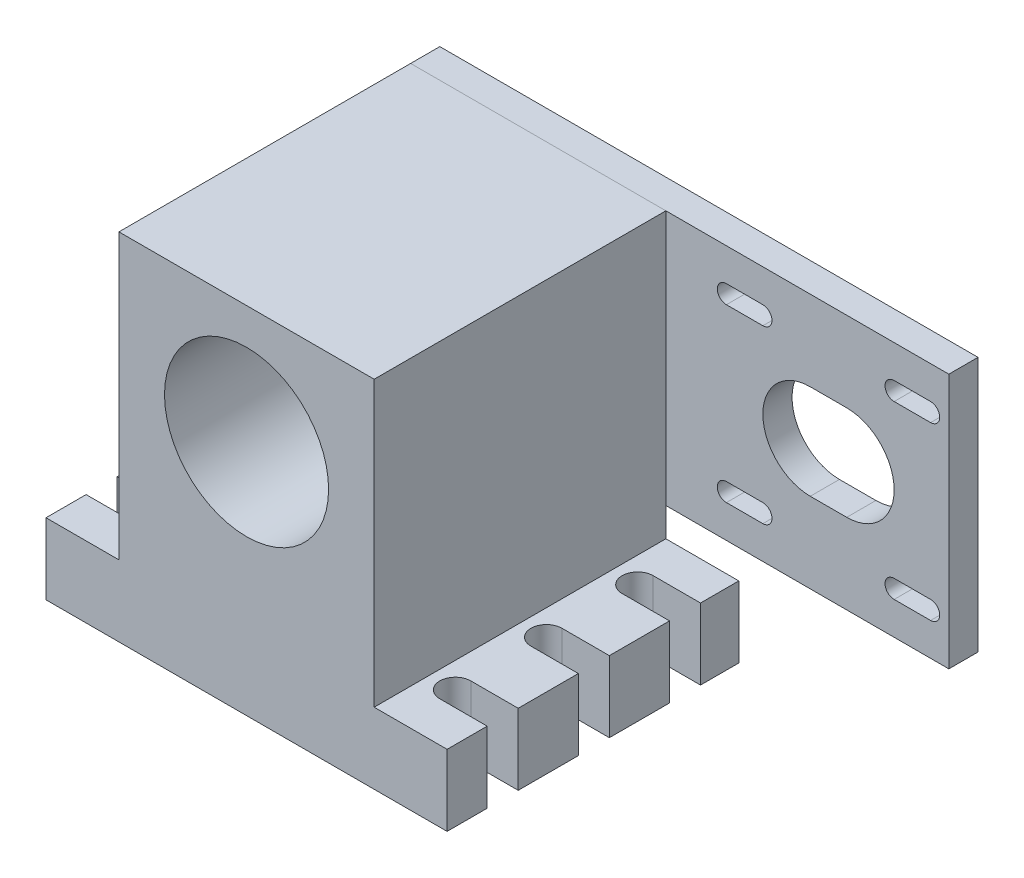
ISO-10303-21;
HEADER;
FILE_DESCRIPTION(('STEP AP214'),'2;1');
FILE_NAME('part.step','',(''),(''),'','','');
FILE_SCHEMA(('AUTOMOTIVE_DESIGN { 1 0 10303 214 1 1 1 1 }'));
ENDSEC;
DATA;
#1=APPLICATION_CONTEXT('core data for automotive mechanical design processes');
#2=APPLICATION_PROTOCOL_DEFINITION('international standard','automotive_design',2000,#1);
#3=PRODUCT_CONTEXT('',#1,'mechanical');
#4=PRODUCT('Part','Part','',(#3));
#5=PRODUCT_RELATED_PRODUCT_CATEGORY('part','',(#4));
#6=PRODUCT_DEFINITION_FORMATION('','',#4);
#7=PRODUCT_DEFINITION_CONTEXT('part definition',#1,'design');
#8=PRODUCT_DEFINITION('design','',#6,#7);
#9=PRODUCT_DEFINITION_SHAPE('','',#8);
#10=(LENGTH_UNIT() NAMED_UNIT(*) SI_UNIT(.MILLI.,.METRE.));
#11=(NAMED_UNIT(*) PLANE_ANGLE_UNIT() SI_UNIT($,.RADIAN.));
#12=(NAMED_UNIT(*) SI_UNIT($,.STERADIAN.) SOLID_ANGLE_UNIT());
#13=UNCERTAINTY_MEASURE_WITH_UNIT(LENGTH_MEASURE(1.E-05),#10,'distance_accuracy_value','');
#14=(GEOMETRIC_REPRESENTATION_CONTEXT(3) GLOBAL_UNCERTAINTY_ASSIGNED_CONTEXT((#13)) GLOBAL_UNIT_ASSIGNED_CONTEXT((#10,
#11,#12)) REPRESENTATION_CONTEXT('',''));
#15=CARTESIAN_POINT('',(0.,0.,0.));
#16=DIRECTION('',(0.,0.,1.));
#17=DIRECTION('',(1.,0.,0.));
#18=AXIS2_PLACEMENT_3D('',#15,#16,#17);
#19=CARTESIAN_POINT('',(-35.,97.4,-48.));
#20=DIRECTION('',(1.,0.,0.));
#21=DIRECTION('',(0.,1.,0.));
#22=AXIS2_PLACEMENT_3D('',#19,#20,#21);
#23=PLANE('',#22);
#24=DIRECTION('',(0.,1.,0.));
#25=VECTOR('',#24,1.);
#26=CARTESIAN_POINT('',(-35.,97.4,-40.));
#27=LINE('',#26,#25);
#28=CARTESIAN_POINT('',(-35.,27.4,-40.));
#29=VERTEX_POINT('',#28);
#30=CARTESIAN_POINT('',(-35.,97.4,-40.));
#31=VERTEX_POINT('',#30);
#32=EDGE_CURVE('E316',#29,#31,#27,.T.);
#33=ORIENTED_EDGE('',*,*,#32,.T.);
#34=DIRECTION('',(0.,0.,1.));
#35=VECTOR('',#34,1.);
#36=CARTESIAN_POINT('',(-35.,97.4,-48.));
#37=LINE('',#36,#35);
#38=CARTESIAN_POINT('',(-35.,97.4,-48.));
#39=VERTEX_POINT('',#38);
#40=EDGE_CURVE('E345',#39,#31,#37,.T.);
#41=ORIENTED_EDGE('',*,*,#40,.F.);
#42=DIRECTION('',(0.,1.,0.));
#43=VECTOR('',#42,1.);
#44=CARTESIAN_POINT('',(-35.,97.4,-48.));
#45=LINE('',#44,#43);
#46=CARTESIAN_POINT('',(-35.,27.4,-48.));
#47=VERTEX_POINT('',#46);
#48=EDGE_CURVE('E319',#47,#39,#45,.T.);
#49=ORIENTED_EDGE('',*,*,#48,.F.);
#50=DIRECTION('',(0.,0.,1.));
#51=VECTOR('',#50,1.);
#52=CARTESIAN_POINT('',(-35.,27.4,-48.));
#53=LINE('',#52,#51);
#54=EDGE_CURVE('E329',#47,#29,#53,.T.);
#55=ORIENTED_EDGE('',*,*,#54,.T.);
#56=EDGE_LOOP('',(#33,#41,#49,#55));
#57=FACE_BOUND('',#56,.T.);
#58=ADVANCED_FACE('F42',(#57),#23,.F.);
#59=CARTESIAN_POINT('',(-35.,97.4,-48.));
#60=DIRECTION('',(0.,-1.,0.));
#61=DIRECTION('',(1.,0.,0.));
#62=AXIS2_PLACEMENT_3D('',#59,#60,#61);
#63=PLANE('',#62);
#64=DIRECTION('',(1.,0.,0.));
#65=VECTOR('',#64,1.);
#66=CARTESIAN_POINT('',(-35.,97.4,-40.));
#67=LINE('',#66,#65);
#68=CARTESIAN_POINT('',(112.6,97.4,-40.));
#69=VERTEX_POINT('',#68);
#70=EDGE_CURVE('E332',#31,#69,#67,.T.);
#71=ORIENTED_EDGE('',*,*,#70,.T.);
#72=DIRECTION('',(0.,0.,1.));
#73=VECTOR('',#72,1.);
#74=CARTESIAN_POINT('',(112.6,97.4,-48.));
#75=LINE('',#74,#73);
#76=CARTESIAN_POINT('',(112.6,97.4,-48.));
#77=VERTEX_POINT('',#76);
#78=EDGE_CURVE('E342',#77,#69,#75,.T.);
#79=ORIENTED_EDGE('',*,*,#78,.F.);
#80=DIRECTION('',(1.,0.,0.));
#81=VECTOR('',#80,1.);
#82=CARTESIAN_POINT('',(-35.,97.4,-48.));
#83=LINE('',#82,#81);
#84=EDGE_CURVE('E322',#39,#77,#83,.T.);
#85=ORIENTED_EDGE('',*,*,#84,.F.);
#86=ORIENTED_EDGE('',*,*,#40,.T.);
#87=EDGE_LOOP('',(#71,#79,#85,#86));
#88=FACE_BOUND('',#87,.T.);
#89=ADVANCED_FACE('F409',(#88),#63,.F.);
#90=CARTESIAN_POINT('',(112.6,97.4,-48.));
#91=DIRECTION('',(-1.,0.,0.));
#92=DIRECTION('',(0.,-1.,0.));
#93=AXIS2_PLACEMENT_3D('',#90,#91,#92);
#94=PLANE('',#93);
#95=DIRECTION('',(0.,-1.,0.));
#96=VECTOR('',#95,1.);
#97=CARTESIAN_POINT('',(112.6,97.4,-40.));
#98=LINE('',#97,#96);
#99=CARTESIAN_POINT('',(112.6,27.4,-40.));
#100=VERTEX_POINT('',#99);
#101=EDGE_CURVE('E334',#69,#100,#98,.T.);
#102=ORIENTED_EDGE('',*,*,#101,.T.);
#103=DIRECTION('',(0.,0.,1.));
#104=VECTOR('',#103,1.);
#105=CARTESIAN_POINT('',(112.6,27.4,-48.));
#106=LINE('',#105,#104);
#107=CARTESIAN_POINT('',(112.6,27.4,-48.));
#108=VERTEX_POINT('',#107);
#109=EDGE_CURVE('E339',#108,#100,#106,.T.);
#110=ORIENTED_EDGE('',*,*,#109,.F.);
#111=DIRECTION('',(0.,-1.,0.));
#112=VECTOR('',#111,1.);
#113=CARTESIAN_POINT('',(112.6,97.4,-48.));
#114=LINE('',#113,#112);
#115=EDGE_CURVE('E325',#77,#108,#114,.T.);
#116=ORIENTED_EDGE('',*,*,#115,.F.);
#117=ORIENTED_EDGE('',*,*,#78,.T.);
#118=EDGE_LOOP('',(#102,#110,#116,#117));
#119=FACE_BOUND('',#118,.T.);
#120=ADVANCED_FACE('F414',(#119),#94,.F.);
#121=CARTESIAN_POINT('',(-35.,27.4,-48.));
#122=DIRECTION('',(0.,1.,0.));
#123=DIRECTION('',(-1.,0.,0.));
#124=AXIS2_PLACEMENT_3D('',#121,#122,#123);
#125=PLANE('',#124);
#126=DIRECTION('',(-1.,0.,0.));
#127=VECTOR('',#126,1.);
#128=CARTESIAN_POINT('',(-35.,27.4,-40.));
#129=LINE('',#128,#127);
#130=EDGE_CURVE('E323',#100,#29,#129,.T.);
#131=ORIENTED_EDGE('',*,*,#130,.T.);
#132=ORIENTED_EDGE('',*,*,#54,.F.);
#133=DIRECTION('',(-1.,0.,0.));
#134=VECTOR('',#133,1.);
#135=CARTESIAN_POINT('',(-35.,27.4,-48.));
#136=LINE('',#135,#134);
#137=EDGE_CURVE('E327',#108,#47,#136,.T.);
#138=ORIENTED_EDGE('',*,*,#137,.F.);
#139=ORIENTED_EDGE('',*,*,#109,.T.);
#140=EDGE_LOOP('',(#131,#132,#138,#139));
#141=FACE_BOUND('',#140,.T.);
#142=ADVANCED_FACE('F429',(#141),#125,.F.);
#143=CARTESIAN_POINT('',(0.,0.,-48.));
#144=DIRECTION('',(0.,0.,1.));
#145=DIRECTION('',(1.,0.,0.));
#146=AXIS2_PLACEMENT_3D('',#143,#144,#145);
#147=PLANE('',#146);
#148=DIRECTION('',(-1.,0.,0.));
#149=VECTOR('',#148,1.);
#150=CARTESIAN_POINT('',(84.6,49.4,-48.));
#151=LINE('',#150,#149);
#152=CARTESIAN_POINT('',(84.6,49.4,-48.));
#153=VERTEX_POINT('',#152);
#154=CARTESIAN_POINT('',(74.6,49.4000000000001,-48.));
#155=VERTEX_POINT('',#154);
#156=EDGE_CURVE('E218',#153,#155,#151,.T.);
#157=ORIENTED_EDGE('',*,*,#156,.F.);
#158=CARTESIAN_POINT('',(84.6,62.4,-48.));
#159=DIRECTION('',(0.,0.,-1.));
#160=DIRECTION('',(-1.,0.,0.));
#161=AXIS2_PLACEMENT_3D('',#158,#159,#160);
#162=CIRCLE('',#161,13.);
#163=CARTESIAN_POINT('',(84.6,75.4,-48.));
#164=VERTEX_POINT('',#163);
#165=EDGE_CURVE('E56',#164,#153,#162,.T.);
#166=ORIENTED_EDGE('',*,*,#165,.F.);
#167=DIRECTION('',(1.,0.,0.));
#168=VECTOR('',#167,1.);
#169=CARTESIAN_POINT('',(84.6,75.4,-48.));
#170=LINE('',#169,#168);
#171=CARTESIAN_POINT('',(74.6,75.4,-48.));
#172=VERTEX_POINT('',#171);
#173=EDGE_CURVE('E225',#172,#164,#170,.T.);
#174=ORIENTED_EDGE('',*,*,#173,.F.);
#175=CARTESIAN_POINT('',(74.6,62.4,-48.));
#176=DIRECTION('',(0.,0.,-1.));
#177=DIRECTION('',(-1.,0.,0.));
#178=AXIS2_PLACEMENT_3D('',#175,#176,#177);
#179=CIRCLE('',#178,13.);
#180=EDGE_CURVE('E208',#155,#172,#179,.T.);
#181=ORIENTED_EDGE('',*,*,#180,.F.);
#182=EDGE_LOOP('',(#157,#166,#174,#181));
#183=FACE_BOUND('',#182,.T.);
#184=DIRECTION('',(-1.,0.,0.));
#185=VECTOR('',#184,1.);
#186=CARTESIAN_POINT('',(107.6,83.4,-48.));
#187=LINE('',#186,#185);
#188=CARTESIAN_POINT('',(107.6,83.4,-48.));
#189=VERTEX_POINT('',#188);
#190=CARTESIAN_POINT('',(97.6,83.4,-48.));
#191=VERTEX_POINT('',#190);
#192=EDGE_CURVE('E236',#189,#191,#187,.T.);
#193=ORIENTED_EDGE('',*,*,#192,.F.);
#194=CARTESIAN_POINT('',(107.6,85.9,-48.));
#195=DIRECTION('',(0.,0.,-1.));
#196=DIRECTION('',(-1.,0.,0.));
#197=AXIS2_PLACEMENT_3D('',#194,#195,#196);
#198=CIRCLE('',#197,2.5);
#199=CARTESIAN_POINT('',(107.6,88.4,-48.));
#200=VERTEX_POINT('',#199);
#201=EDGE_CURVE('E64',#200,#189,#198,.T.);
#202=ORIENTED_EDGE('',*,*,#201,.F.);
#203=DIRECTION('',(1.,0.,0.));
#204=VECTOR('',#203,1.);
#205=CARTESIAN_POINT('',(107.6,88.4,-48.));
#206=LINE('',#205,#204);
#207=CARTESIAN_POINT('',(97.6,88.4,-48.));
#208=VERTEX_POINT('',#207);
#209=EDGE_CURVE('E243',#208,#200,#206,.T.);
#210=ORIENTED_EDGE('',*,*,#209,.F.);
#211=CARTESIAN_POINT('',(97.6,85.9,-48.));
#212=DIRECTION('',(0.,0.,-1.));
#213=DIRECTION('',(-1.,0.,0.));
#214=AXIS2_PLACEMENT_3D('',#211,#212,#213);
#215=CIRCLE('',#214,2.5);
#216=EDGE_CURVE('E240',#191,#208,#215,.T.);
#217=ORIENTED_EDGE('',*,*,#216,.F.);
#218=EDGE_LOOP('',(#193,#202,#210,#217));
#219=FACE_BOUND('',#218,.T.);
#220=DIRECTION('',(-1.,0.,0.));
#221=VECTOR('',#220,1.);
#222=CARTESIAN_POINT('',(61.6,83.4,-48.));
#223=LINE('',#222,#221);
#224=CARTESIAN_POINT('',(61.6,83.4,-48.));
#225=VERTEX_POINT('',#224);
#226=CARTESIAN_POINT('',(51.6,83.4,-48.));
#227=VERTEX_POINT('',#226);
#228=EDGE_CURVE('E256',#225,#227,#223,.T.);
#229=ORIENTED_EDGE('',*,*,#228,.F.);
#230=CARTESIAN_POINT('',(61.6,85.9,-48.));
#231=DIRECTION('',(0.,0.,-1.));
#232=DIRECTION('',(-1.,0.,0.));
#233=AXIS2_PLACEMENT_3D('',#230,#231,#232);
#234=CIRCLE('',#233,2.5);
#235=CARTESIAN_POINT('',(61.6,88.4,-48.));
#236=VERTEX_POINT('',#235);
#237=EDGE_CURVE('E254',#236,#225,#234,.T.);
#238=ORIENTED_EDGE('',*,*,#237,.F.);
#239=DIRECTION('',(1.,0.,0.));
#240=VECTOR('',#239,1.);
#241=CARTESIAN_POINT('',(61.6,88.4,-48.));
#242=LINE('',#241,#240);
#243=CARTESIAN_POINT('',(51.6,88.4,-48.));
#244=VERTEX_POINT('',#243);
#245=EDGE_CURVE('E263',#244,#236,#242,.T.);
#246=ORIENTED_EDGE('',*,*,#245,.F.);
#247=CARTESIAN_POINT('',(51.6,85.9,-48.));
#248=DIRECTION('',(0.,0.,-1.));
#249=DIRECTION('',(-1.,0.,0.));
#250=AXIS2_PLACEMENT_3D('',#247,#248,#249);
#251=CIRCLE('',#250,2.5);
#252=EDGE_CURVE('E260',#227,#244,#251,.T.);
#253=ORIENTED_EDGE('',*,*,#252,.F.);
#254=EDGE_LOOP('',(#229,#238,#246,#253));
#255=FACE_BOUND('',#254,.T.);
#256=DIRECTION('',(-1.,0.,0.));
#257=VECTOR('',#256,1.);
#258=CARTESIAN_POINT('',(61.6,36.4,-48.));
#259=LINE('',#258,#257);
#260=CARTESIAN_POINT('',(61.6,36.4,-48.));
#261=VERTEX_POINT('',#260);
#262=CARTESIAN_POINT('',(51.6,36.4,-48.));
#263=VERTEX_POINT('',#262);
#264=EDGE_CURVE('E276',#261,#263,#259,.T.);
#265=ORIENTED_EDGE('',*,*,#264,.F.);
#266=CARTESIAN_POINT('',(61.6,38.9,-48.));
#267=DIRECTION('',(0.,0.,-1.));
#268=DIRECTION('',(-1.,0.,0.));
#269=AXIS2_PLACEMENT_3D('',#266,#267,#268);
#270=CIRCLE('',#269,2.5);
#271=CARTESIAN_POINT('',(61.6,41.4,-48.));
#272=VERTEX_POINT('',#271);
#273=EDGE_CURVE('E274',#272,#261,#270,.T.);
#274=ORIENTED_EDGE('',*,*,#273,.F.);
#275=DIRECTION('',(1.,0.,0.));
#276=VECTOR('',#275,1.);
#277=CARTESIAN_POINT('',(61.6,41.4,-48.));
#278=LINE('',#277,#276);
#279=CARTESIAN_POINT('',(51.6,41.4,-48.));
#280=VERTEX_POINT('',#279);
#281=EDGE_CURVE('E283',#280,#272,#278,.T.);
#282=ORIENTED_EDGE('',*,*,#281,.F.);
#283=CARTESIAN_POINT('',(51.6,38.9,-48.));
#284=DIRECTION('',(0.,0.,-1.));
#285=DIRECTION('',(-1.,0.,0.));
#286=AXIS2_PLACEMENT_3D('',#283,#284,#285);
#287=CIRCLE('',#286,2.5);
#288=EDGE_CURVE('E280',#263,#280,#287,.T.);
#289=ORIENTED_EDGE('',*,*,#288,.F.);
#290=EDGE_LOOP('',(#265,#274,#282,#289));
#291=FACE_BOUND('',#290,.T.);
#292=DIRECTION('',(-1.,0.,0.));
#293=VECTOR('',#292,1.);
#294=CARTESIAN_POINT('',(107.6,36.4,-48.));
#295=LINE('',#294,#293);
#296=CARTESIAN_POINT('',(107.6,36.4,-48.));
#297=VERTEX_POINT('',#296);
#298=CARTESIAN_POINT('',(97.6,36.4,-48.));
#299=VERTEX_POINT('',#298);
#300=EDGE_CURVE('E296',#297,#299,#295,.T.);
#301=ORIENTED_EDGE('',*,*,#300,.F.);
#302=CARTESIAN_POINT('',(107.6,38.9,-48.));
#303=DIRECTION('',(0.,0.,-1.));
#304=DIRECTION('',(-1.,0.,0.));
#305=AXIS2_PLACEMENT_3D('',#302,#303,#304);
#306=CIRCLE('',#305,2.5);
#307=CARTESIAN_POINT('',(107.6,41.4,-48.));
#308=VERTEX_POINT('',#307);
#309=EDGE_CURVE('E294',#308,#297,#306,.T.);
#310=ORIENTED_EDGE('',*,*,#309,.F.);
#311=DIRECTION('',(1.,0.,0.));
#312=VECTOR('',#311,1.);
#313=CARTESIAN_POINT('',(107.6,41.4,-48.));
#314=LINE('',#313,#312);
#315=CARTESIAN_POINT('',(97.6,41.4,-48.));
#316=VERTEX_POINT('',#315);
#317=EDGE_CURVE('E302',#316,#308,#314,.T.);
#318=ORIENTED_EDGE('',*,*,#317,.F.);
#319=CARTESIAN_POINT('',(97.6,38.9,-48.));
#320=DIRECTION('',(0.,0.,-1.));
#321=DIRECTION('',(-1.,0.,0.));
#322=AXIS2_PLACEMENT_3D('',#319,#320,#321);
#323=CIRCLE('',#322,2.5);
#324=EDGE_CURVE('E299',#299,#316,#323,.T.);
#325=ORIENTED_EDGE('',*,*,#324,.F.);
#326=EDGE_LOOP('',(#301,#310,#318,#325));
#327=FACE_BOUND('',#326,.T.);
#328=CARTESIAN_POINT('',(0.,65.,-48.));
#329=DIRECTION('',(0.,0.,1.));
#330=DIRECTION('',(1.,0.,0.));
#331=AXIS2_PLACEMENT_3D('',#328,#329,#330);
#332=CIRCLE('',#331,12.5);
#333=CARTESIAN_POINT('',(12.5,65.,-48.));
#334=VERTEX_POINT('',#333);
#335=EDGE_CURVE('E313',#334,#334,#332,.T.);
#336=ORIENTED_EDGE('',*,*,#335,.T.);
#337=EDGE_LOOP('',(#336));
#338=FACE_BOUND('',#337,.T.);
#339=ORIENTED_EDGE('',*,*,#48,.T.);
#340=ORIENTED_EDGE('',*,*,#84,.T.);
#341=ORIENTED_EDGE('',*,*,#115,.T.);
#342=ORIENTED_EDGE('',*,*,#137,.T.);
#343=EDGE_LOOP('',(#339,#340,#341,#342));
#344=FACE_BOUND('',#343,.T.);
#345=ADVANCED_FACE('F222',(#183,#219,#255,#291,#327,#338,#344),#147,.F.);
#346=CARTESIAN_POINT('',(0.,0.,-40.));
#347=DIRECTION('',(0.,0.,1.));
#348=DIRECTION('',(1.,0.,0.));
#349=AXIS2_PLACEMENT_3D('',#346,#347,#348);
#350=PLANE('',#349);
#351=CARTESIAN_POINT('',(84.6,62.4,-40.));
#352=DIRECTION('',(0.,0.,1.));
#353=DIRECTION('',(1.,0.,0.));
#354=AXIS2_PLACEMENT_3D('',#351,#352,#353);
#355=CIRCLE('',#354,13.);
#356=CARTESIAN_POINT('',(84.6,49.4,-40.));
#357=VERTEX_POINT('',#356);
#358=CARTESIAN_POINT('',(84.6,75.4,-40.));
#359=VERTEX_POINT('',#358);
#360=EDGE_CURVE('E12',#357,#359,#355,.T.);
#361=ORIENTED_EDGE('',*,*,#360,.F.);
#362=DIRECTION('',(1.,0.,0.));
#363=VECTOR('',#362,1.);
#364=CARTESIAN_POINT('',(0.,49.4,-40.));
#365=LINE('',#364,#363);
#366=CARTESIAN_POINT('',(74.6,49.4,-40.));
#367=VERTEX_POINT('',#366);
#368=EDGE_CURVE('E384',#367,#357,#365,.T.);
#369=ORIENTED_EDGE('',*,*,#368,.F.);
#370=CARTESIAN_POINT('',(74.6,62.4,-40.));
#371=DIRECTION('',(0.,0.,1.));
#372=DIRECTION('',(1.,0.,0.));
#373=AXIS2_PLACEMENT_3D('',#370,#371,#372);
#374=CIRCLE('',#373,13.);
#375=CARTESIAN_POINT('',(74.6,75.4,-40.));
#376=VERTEX_POINT('',#375);
#377=EDGE_CURVE('E211',#376,#367,#374,.T.);
#378=ORIENTED_EDGE('',*,*,#377,.F.);
#379=DIRECTION('',(-1.,0.,0.));
#380=VECTOR('',#379,1.);
#381=CARTESIAN_POINT('',(0.,75.4,-40.));
#382=LINE('',#381,#380);
#383=EDGE_CURVE('E49',#359,#376,#382,.T.);
#384=ORIENTED_EDGE('',*,*,#383,.F.);
#385=EDGE_LOOP('',(#361,#369,#378,#384));
#386=FACE_BOUND('',#385,.T.);
#387=CARTESIAN_POINT('',(107.6,85.9,-40.));
#388=DIRECTION('',(0.,0.,1.));
#389=DIRECTION('',(1.,0.,0.));
#390=AXIS2_PLACEMENT_3D('',#387,#388,#389);
#391=CIRCLE('',#390,2.5);
#392=CARTESIAN_POINT('',(107.6,83.4,-40.));
#393=VERTEX_POINT('',#392);
#394=CARTESIAN_POINT('',(107.6,88.4,-40.));
#395=VERTEX_POINT('',#394);
#396=EDGE_CURVE('E382',#393,#395,#391,.T.);
#397=ORIENTED_EDGE('',*,*,#396,.F.);
#398=DIRECTION('',(1.,0.,0.));
#399=VECTOR('',#398,1.);
#400=CARTESIAN_POINT('',(0.,83.4,-40.));
#401=LINE('',#400,#399);
#402=CARTESIAN_POINT('',(97.6,83.4,-40.));
#403=VERTEX_POINT('',#402);
#404=EDGE_CURVE('E375',#403,#393,#401,.T.);
#405=ORIENTED_EDGE('',*,*,#404,.F.);
#406=CARTESIAN_POINT('',(97.6,85.9,-40.));
#407=DIRECTION('',(0.,0.,1.));
#408=DIRECTION('',(1.,0.,0.));
#409=AXIS2_PLACEMENT_3D('',#406,#407,#408);
#410=CIRCLE('',#409,2.5);
#411=CARTESIAN_POINT('',(97.6,88.4,-40.));
#412=VERTEX_POINT('',#411);
#413=EDGE_CURVE('E377',#412,#403,#410,.T.);
#414=ORIENTED_EDGE('',*,*,#413,.F.);
#415=DIRECTION('',(-1.,0.,0.));
#416=VECTOR('',#415,1.);
#417=CARTESIAN_POINT('',(0.,88.4,-40.));
#418=LINE('',#417,#416);
#419=EDGE_CURVE('E380',#395,#412,#418,.T.);
#420=ORIENTED_EDGE('',*,*,#419,.F.);
#421=EDGE_LOOP('',(#397,#405,#414,#420));
#422=FACE_BOUND('',#421,.T.);
#423=CARTESIAN_POINT('',(61.6,85.9,-40.));
#424=DIRECTION('',(0.,0.,1.));
#425=DIRECTION('',(1.,0.,0.));
#426=AXIS2_PLACEMENT_3D('',#423,#424,#425);
#427=CIRCLE('',#426,2.5);
#428=CARTESIAN_POINT('',(61.6,83.4,-40.));
#429=VERTEX_POINT('',#428);
#430=CARTESIAN_POINT('',(61.6,88.4,-40.));
#431=VERTEX_POINT('',#430);
#432=EDGE_CURVE('E373',#429,#431,#427,.T.);
#433=ORIENTED_EDGE('',*,*,#432,.F.);
#434=DIRECTION('',(1.,0.,0.));
#435=VECTOR('',#434,1.);
#436=CARTESIAN_POINT('',(0.,83.4,-40.));
#437=LINE('',#436,#435);
#438=CARTESIAN_POINT('',(51.6,83.4,-40.));
#439=VERTEX_POINT('',#438);
#440=EDGE_CURVE('E366',#439,#429,#437,.T.);
#441=ORIENTED_EDGE('',*,*,#440,.F.);
#442=CARTESIAN_POINT('',(51.6,85.9,-40.));
#443=DIRECTION('',(0.,0.,1.));
#444=DIRECTION('',(1.,0.,0.));
#445=AXIS2_PLACEMENT_3D('',#442,#443,#444);
#446=CIRCLE('',#445,2.5);
#447=CARTESIAN_POINT('',(51.6,88.4,-40.));
#448=VERTEX_POINT('',#447);
#449=EDGE_CURVE('E368',#448,#439,#446,.T.);
#450=ORIENTED_EDGE('',*,*,#449,.F.);
#451=DIRECTION('',(-1.,0.,0.));
#452=VECTOR('',#451,1.);
#453=CARTESIAN_POINT('',(0.,88.4,-40.));
#454=LINE('',#453,#452);
#455=EDGE_CURVE('E371',#431,#448,#454,.T.);
#456=ORIENTED_EDGE('',*,*,#455,.F.);
#457=EDGE_LOOP('',(#433,#441,#450,#456));
#458=FACE_BOUND('',#457,.T.);
#459=CARTESIAN_POINT('',(61.6,38.9,-40.));
#460=DIRECTION('',(0.,0.,1.));
#461=DIRECTION('',(1.,0.,0.));
#462=AXIS2_PLACEMENT_3D('',#459,#460,#461);
#463=CIRCLE('',#462,2.5);
#464=CARTESIAN_POINT('',(61.6,36.4,-40.));
#465=VERTEX_POINT('',#464);
#466=CARTESIAN_POINT('',(61.6,41.4,-40.));
#467=VERTEX_POINT('',#466);
#468=EDGE_CURVE('E364',#465,#467,#463,.T.);
#469=ORIENTED_EDGE('',*,*,#468,.F.);
#470=DIRECTION('',(1.,0.,0.));
#471=VECTOR('',#470,1.);
#472=CARTESIAN_POINT('',(0.,36.4,-40.));
#473=LINE('',#472,#471);
#474=CARTESIAN_POINT('',(51.6,36.4,-40.));
#475=VERTEX_POINT('',#474);
#476=EDGE_CURVE('E357',#475,#465,#473,.T.);
#477=ORIENTED_EDGE('',*,*,#476,.F.);
#478=CARTESIAN_POINT('',(51.6,38.9,-40.));
#479=DIRECTION('',(0.,0.,1.));
#480=DIRECTION('',(1.,0.,0.));
#481=AXIS2_PLACEMENT_3D('',#478,#479,#480);
#482=CIRCLE('',#481,2.5);
#483=CARTESIAN_POINT('',(51.6,41.4,-40.));
#484=VERTEX_POINT('',#483);
#485=EDGE_CURVE('E359',#484,#475,#482,.T.);
#486=ORIENTED_EDGE('',*,*,#485,.F.);
#487=DIRECTION('',(-1.,0.,0.));
#488=VECTOR('',#487,1.);
#489=CARTESIAN_POINT('',(0.,41.4,-40.));
#490=LINE('',#489,#488);
#491=EDGE_CURVE('E362',#467,#484,#490,.T.);
#492=ORIENTED_EDGE('',*,*,#491,.F.);
#493=EDGE_LOOP('',(#469,#477,#486,#492));
#494=FACE_BOUND('',#493,.T.);
#495=CARTESIAN_POINT('',(107.6,38.9,-40.));
#496=DIRECTION('',(0.,0.,1.));
#497=DIRECTION('',(1.,0.,0.));
#498=AXIS2_PLACEMENT_3D('',#495,#496,#497);
#499=CIRCLE('',#498,2.5);
#500=CARTESIAN_POINT('',(107.6,36.4,-40.));
#501=VERTEX_POINT('',#500);
#502=CARTESIAN_POINT('',(107.6,41.4,-40.));
#503=VERTEX_POINT('',#502);
#504=EDGE_CURVE('E355',#501,#503,#499,.T.);
#505=ORIENTED_EDGE('',*,*,#504,.F.);
#506=DIRECTION('',(1.,0.,0.));
#507=VECTOR('',#506,1.);
#508=CARTESIAN_POINT('',(0.,36.4,-40.));
#509=LINE('',#508,#507);
#510=CARTESIAN_POINT('',(97.6,36.4,-40.));
#511=VERTEX_POINT('',#510);
#512=EDGE_CURVE('E348',#511,#501,#509,.T.);
#513=ORIENTED_EDGE('',*,*,#512,.F.);
#514=CARTESIAN_POINT('',(97.6,38.9,-40.));
#515=DIRECTION('',(0.,0.,1.));
#516=DIRECTION('',(1.,0.,0.));
#517=AXIS2_PLACEMENT_3D('',#514,#515,#516);
#518=CIRCLE('',#517,2.5);
#519=CARTESIAN_POINT('',(97.6,41.4,-40.));
#520=VERTEX_POINT('',#519);
#521=EDGE_CURVE('E350',#520,#511,#518,.T.);
#522=ORIENTED_EDGE('',*,*,#521,.F.);
#523=DIRECTION('',(-1.,0.,0.));
#524=VECTOR('',#523,1.);
#525=CARTESIAN_POINT('',(0.,41.4,-40.));
#526=LINE('',#525,#524);
#527=EDGE_CURVE('E353',#503,#520,#526,.T.);
#528=ORIENTED_EDGE('',*,*,#527,.F.);
#529=EDGE_LOOP('',(#505,#513,#522,#528));
#530=FACE_BOUND('',#529,.T.);
#531=CARTESIAN_POINT('',(0.,65.,-40.));
#532=DIRECTION('',(0.,0.,1.));
#533=DIRECTION('',(1.,0.,0.));
#534=AXIS2_PLACEMENT_3D('',#531,#532,#533);
#535=CIRCLE('',#534,12.5);
#536=CARTESIAN_POINT('',(12.5,65.,-40.));
#537=VERTEX_POINT('',#536);
#538=EDGE_CURVE('E232',#537,#537,#535,.T.);
#539=ORIENTED_EDGE('',*,*,#538,.F.);
#540=EDGE_LOOP('',(#539));
#541=FACE_BOUND('',#540,.T.);
#542=ORIENTED_EDGE('',*,*,#32,.F.);
#543=ORIENTED_EDGE('',*,*,#130,.F.);
#544=ORIENTED_EDGE('',*,*,#101,.F.);
#545=ORIENTED_EDGE('',*,*,#70,.F.);
#546=EDGE_LOOP('',(#542,#543,#544,#545));
#547=FACE_BOUND('',#546,.T.);
#548=ADVANCED_FACE('F392',(#386,#422,#458,#494,#530,#541,#547),#350,.T.);
#549=CARTESIAN_POINT('',(0.,65.,-48.));
#550=DIRECTION('',(0.,0.,1.));
#551=DIRECTION('',(1.,0.,0.));
#552=AXIS2_PLACEMENT_3D('',#549,#550,#551);
#553=CYLINDRICAL_SURFACE('',#552,12.5);
#554=ORIENTED_EDGE('',*,*,#335,.F.);
#555=EDGE_LOOP('',(#554));
#556=FACE_BOUND('',#555,.T.);
#557=ORIENTED_EDGE('',*,*,#538,.T.);
#558=EDGE_LOOP('',(#557));
#559=FACE_BOUND('',#558,.T.);
#560=ADVANCED_FACE('F440',(#556,#559),#553,.F.);
#561=CARTESIAN_POINT('',(107.6,38.9,40.00005));
#562=DIRECTION('',(0.,0.,-1.));
#563=DIRECTION('',(-1.,0.,0.));
#564=AXIS2_PLACEMENT_3D('',#561,#562,#563);
#565=CYLINDRICAL_SURFACE('',#564,2.5);
#566=ORIENTED_EDGE('',*,*,#504,.T.);
#567=DIRECTION('',(0.,0.,-1.));
#568=VECTOR('',#567,1.);
#569=CARTESIAN_POINT('',(107.6,41.4,40.00005));
#570=LINE('',#569,#568);
#571=EDGE_CURVE('E277',#503,#308,#570,.T.);
#572=ORIENTED_EDGE('',*,*,#571,.T.);
#573=ORIENTED_EDGE('',*,*,#309,.T.);
#574=DIRECTION('',(0.,0.,-1.));
#575=VECTOR('',#574,1.);
#576=CARTESIAN_POINT('',(107.6,36.4,40.00005));
#577=LINE('',#576,#575);
#578=EDGE_CURVE('E305',#501,#297,#577,.T.);
#579=ORIENTED_EDGE('',*,*,#578,.F.);
#580=EDGE_LOOP('',(#566,#572,#573,#579));
#581=FACE_BOUND('',#580,.T.);
#582=ADVANCED_FACE('F445',(#581),#565,.F.);
#583=CARTESIAN_POINT('',(107.6,41.4,40.00005));
#584=DIRECTION('',(0.,1.,0.));
#585=DIRECTION('',(0.,0.,1.));
#586=AXIS2_PLACEMENT_3D('',#583,#584,#585);
#587=PLANE('',#586);
#588=ORIENTED_EDGE('',*,*,#527,.T.);
#589=DIRECTION('',(0.,0.,-1.));
#590=VECTOR('',#589,1.);
#591=CARTESIAN_POINT('',(97.6,41.4,40.00005));
#592=LINE('',#591,#590);
#593=EDGE_CURVE('E307',#520,#316,#592,.T.);
#594=ORIENTED_EDGE('',*,*,#593,.T.);
#595=ORIENTED_EDGE('',*,*,#317,.T.);
#596=ORIENTED_EDGE('',*,*,#571,.F.);
#597=EDGE_LOOP('',(#588,#594,#595,#596));
#598=FACE_BOUND('',#597,.T.);
#599=ADVANCED_FACE('F449',(#598),#587,.F.);
#600=CARTESIAN_POINT('',(97.6,38.9,40.00005));
#601=DIRECTION('',(0.,0.,-1.));
#602=DIRECTION('',(-1.,0.,0.));
#603=AXIS2_PLACEMENT_3D('',#600,#601,#602);
#604=CYLINDRICAL_SURFACE('',#603,2.5);
#605=ORIENTED_EDGE('',*,*,#521,.T.);
#606=DIRECTION('',(0.,0.,-1.));
#607=VECTOR('',#606,1.);
#608=CARTESIAN_POINT('',(97.6,36.4,40.00005));
#609=LINE('',#608,#607);
#610=EDGE_CURVE('E309',#511,#299,#609,.T.);
#611=ORIENTED_EDGE('',*,*,#610,.T.);
#612=ORIENTED_EDGE('',*,*,#324,.T.);
#613=ORIENTED_EDGE('',*,*,#593,.F.);
#614=EDGE_LOOP('',(#605,#611,#612,#613));
#615=FACE_BOUND('',#614,.T.);
#616=ADVANCED_FACE('F455',(#615),#604,.F.);
#617=CARTESIAN_POINT('',(107.6,36.4,40.00005));
#618=DIRECTION('',(0.,-1.,0.));
#619=DIRECTION('',(0.,0.,-1.));
#620=AXIS2_PLACEMENT_3D('',#617,#618,#619);
#621=PLANE('',#620);
#622=ORIENTED_EDGE('',*,*,#512,.T.);
#623=ORIENTED_EDGE('',*,*,#578,.T.);
#624=ORIENTED_EDGE('',*,*,#300,.T.);
#625=ORIENTED_EDGE('',*,*,#610,.F.);
#626=EDGE_LOOP('',(#622,#623,#624,#625));
#627=FACE_BOUND('',#626,.T.);
#628=ADVANCED_FACE('F451',(#627),#621,.F.);
#629=CARTESIAN_POINT('',(61.6,38.9,40.00005));
#630=DIRECTION('',(0.,0.,-1.));
#631=DIRECTION('',(-1.,0.,0.));
#632=AXIS2_PLACEMENT_3D('',#629,#630,#631);
#633=CYLINDRICAL_SURFACE('',#632,2.5);
#634=ORIENTED_EDGE('',*,*,#468,.T.);
#635=DIRECTION('',(0.,0.,-1.));
#636=VECTOR('',#635,1.);
#637=CARTESIAN_POINT('',(61.6,41.4,40.00005));
#638=LINE('',#637,#636);
#639=EDGE_CURVE('E257',#467,#272,#638,.T.);
#640=ORIENTED_EDGE('',*,*,#639,.T.);
#641=ORIENTED_EDGE('',*,*,#273,.T.);
#642=DIRECTION('',(0.,0.,-1.));
#643=VECTOR('',#642,1.);
#644=CARTESIAN_POINT('',(61.6,36.4,40.00005));
#645=LINE('',#644,#643);
#646=EDGE_CURVE('E286',#465,#261,#645,.T.);
#647=ORIENTED_EDGE('',*,*,#646,.F.);
#648=EDGE_LOOP('',(#634,#640,#641,#647));
#649=FACE_BOUND('',#648,.T.);
#650=ADVANCED_FACE('F454',(#649),#633,.F.);
#651=CARTESIAN_POINT('',(61.6,41.4,40.00005));
#652=DIRECTION('',(0.,1.,0.));
#653=DIRECTION('',(0.,0.,1.));
#654=AXIS2_PLACEMENT_3D('',#651,#652,#653);
#655=PLANE('',#654);
#656=ORIENTED_EDGE('',*,*,#491,.T.);
#657=DIRECTION('',(0.,0.,-1.));
#658=VECTOR('',#657,1.);
#659=CARTESIAN_POINT('',(51.6,41.4,40.00005));
#660=LINE('',#659,#658);
#661=EDGE_CURVE('E288',#484,#280,#660,.T.);
#662=ORIENTED_EDGE('',*,*,#661,.T.);
#663=ORIENTED_EDGE('',*,*,#281,.T.);
#664=ORIENTED_EDGE('',*,*,#639,.F.);
#665=EDGE_LOOP('',(#656,#662,#663,#664));
#666=FACE_BOUND('',#665,.T.);
#667=ADVANCED_FACE('F465',(#666),#655,.F.);
#668=CARTESIAN_POINT('',(51.6,38.9,40.00005));
#669=DIRECTION('',(0.,0.,-1.));
#670=DIRECTION('',(-1.,0.,0.));
#671=AXIS2_PLACEMENT_3D('',#668,#669,#670);
#672=CYLINDRICAL_SURFACE('',#671,2.5);
#673=ORIENTED_EDGE('',*,*,#485,.T.);
#674=DIRECTION('',(0.,0.,-1.));
#675=VECTOR('',#674,1.);
#676=CARTESIAN_POINT('',(51.6,36.4,40.00005));
#677=LINE('',#676,#675);
#678=EDGE_CURVE('E290',#475,#263,#677,.T.);
#679=ORIENTED_EDGE('',*,*,#678,.T.);
#680=ORIENTED_EDGE('',*,*,#288,.T.);
#681=ORIENTED_EDGE('',*,*,#661,.F.);
#682=EDGE_LOOP('',(#673,#679,#680,#681));
#683=FACE_BOUND('',#682,.T.);
#684=ADVANCED_FACE('F471',(#683),#672,.F.);
#685=CARTESIAN_POINT('',(61.6,36.4,40.00005));
#686=DIRECTION('',(0.,-1.,0.));
#687=DIRECTION('',(0.,0.,-1.));
#688=AXIS2_PLACEMENT_3D('',#685,#686,#687);
#689=PLANE('',#688);
#690=ORIENTED_EDGE('',*,*,#476,.T.);
#691=ORIENTED_EDGE('',*,*,#646,.T.);
#692=ORIENTED_EDGE('',*,*,#264,.T.);
#693=ORIENTED_EDGE('',*,*,#678,.F.);
#694=EDGE_LOOP('',(#690,#691,#692,#693));
#695=FACE_BOUND('',#694,.T.);
#696=ADVANCED_FACE('F467',(#695),#689,.F.);
#697=CARTESIAN_POINT('',(61.6,85.9,40.00005));
#698=DIRECTION('',(0.,0.,-1.));
#699=DIRECTION('',(-1.,0.,0.));
#700=AXIS2_PLACEMENT_3D('',#697,#698,#699);
#701=CYLINDRICAL_SURFACE('',#700,2.5);
#702=ORIENTED_EDGE('',*,*,#432,.T.);
#703=DIRECTION('',(0.,0.,-1.));
#704=VECTOR('',#703,1.);
#705=CARTESIAN_POINT('',(61.6,88.4,40.00005));
#706=LINE('',#705,#704);
#707=EDGE_CURVE('E237',#431,#236,#706,.T.);
#708=ORIENTED_EDGE('',*,*,#707,.T.);
#709=ORIENTED_EDGE('',*,*,#237,.T.);
#710=DIRECTION('',(0.,0.,-1.));
#711=VECTOR('',#710,1.);
#712=CARTESIAN_POINT('',(61.6,83.4,40.00005));
#713=LINE('',#712,#711);
#714=EDGE_CURVE('E266',#429,#225,#713,.T.);
#715=ORIENTED_EDGE('',*,*,#714,.F.);
#716=EDGE_LOOP('',(#702,#708,#709,#715));
#717=FACE_BOUND('',#716,.T.);
#718=ADVANCED_FACE('F470',(#717),#701,.F.);
#719=CARTESIAN_POINT('',(61.6,88.4,40.00005));
#720=DIRECTION('',(0.,1.,0.));
#721=DIRECTION('',(0.,0.,1.));
#722=AXIS2_PLACEMENT_3D('',#719,#720,#721);
#723=PLANE('',#722);
#724=ORIENTED_EDGE('',*,*,#455,.T.);
#725=DIRECTION('',(0.,0.,-1.));
#726=VECTOR('',#725,1.);
#727=CARTESIAN_POINT('',(51.6,88.4,40.00005));
#728=LINE('',#727,#726);
#729=EDGE_CURVE('E268',#448,#244,#728,.T.);
#730=ORIENTED_EDGE('',*,*,#729,.T.);
#731=ORIENTED_EDGE('',*,*,#245,.T.);
#732=ORIENTED_EDGE('',*,*,#707,.F.);
#733=EDGE_LOOP('',(#724,#730,#731,#732));
#734=FACE_BOUND('',#733,.T.);
#735=ADVANCED_FACE('F481',(#734),#723,.F.);
#736=CARTESIAN_POINT('',(51.6,85.9,40.00005));
#737=DIRECTION('',(0.,0.,-1.));
#738=DIRECTION('',(-1.,0.,0.));
#739=AXIS2_PLACEMENT_3D('',#736,#737,#738);
#740=CYLINDRICAL_SURFACE('',#739,2.5);
#741=ORIENTED_EDGE('',*,*,#449,.T.);
#742=DIRECTION('',(0.,0.,-1.));
#743=VECTOR('',#742,1.);
#744=CARTESIAN_POINT('',(51.6,83.4,40.00005));
#745=LINE('',#744,#743);
#746=EDGE_CURVE('E270',#439,#227,#745,.T.);
#747=ORIENTED_EDGE('',*,*,#746,.T.);
#748=ORIENTED_EDGE('',*,*,#252,.T.);
#749=ORIENTED_EDGE('',*,*,#729,.F.);
#750=EDGE_LOOP('',(#741,#747,#748,#749));
#751=FACE_BOUND('',#750,.T.);
#752=ADVANCED_FACE('F487',(#751),#740,.F.);
#753=CARTESIAN_POINT('',(61.6,83.4,40.00005));
#754=DIRECTION('',(0.,-1.,0.));
#755=DIRECTION('',(0.,0.,-1.));
#756=AXIS2_PLACEMENT_3D('',#753,#754,#755);
#757=PLANE('',#756);
#758=ORIENTED_EDGE('',*,*,#440,.T.);
#759=ORIENTED_EDGE('',*,*,#714,.T.);
#760=ORIENTED_EDGE('',*,*,#228,.T.);
#761=ORIENTED_EDGE('',*,*,#746,.F.);
#762=EDGE_LOOP('',(#758,#759,#760,#761));
#763=FACE_BOUND('',#762,.T.);
#764=ADVANCED_FACE('F483',(#763),#757,.F.);
#765=CARTESIAN_POINT('',(107.6,85.9,40.00005));
#766=DIRECTION('',(0.,0.,-1.));
#767=DIRECTION('',(-1.,0.,0.));
#768=AXIS2_PLACEMENT_3D('',#765,#766,#767);
#769=CYLINDRICAL_SURFACE('',#768,2.5);
#770=ORIENTED_EDGE('',*,*,#396,.T.);
#771=DIRECTION('',(0.,0.,-1.));
#772=VECTOR('',#771,1.);
#773=CARTESIAN_POINT('',(107.6,88.4,40.00005));
#774=LINE('',#773,#772);
#775=EDGE_CURVE('E247',#395,#200,#774,.T.);
#776=ORIENTED_EDGE('',*,*,#775,.T.);
#777=ORIENTED_EDGE('',*,*,#201,.T.);
#778=DIRECTION('',(0.,0.,-1.));
#779=VECTOR('',#778,1.);
#780=CARTESIAN_POINT('',(107.6,83.4,40.00005));
#781=LINE('',#780,#779);
#782=EDGE_CURVE('E246',#393,#189,#781,.T.);
#783=ORIENTED_EDGE('',*,*,#782,.F.);
#784=EDGE_LOOP('',(#770,#776,#777,#783));
#785=FACE_BOUND('',#784,.T.);
#786=ADVANCED_FACE('F486',(#785),#769,.F.);
#787=CARTESIAN_POINT('',(107.6,88.4,40.00005));
#788=DIRECTION('',(0.,1.,0.));
#789=DIRECTION('',(0.,0.,1.));
#790=AXIS2_PLACEMENT_3D('',#787,#788,#789);
#791=PLANE('',#790);
#792=ORIENTED_EDGE('',*,*,#419,.T.);
#793=DIRECTION('',(0.,0.,-1.));
#794=VECTOR('',#793,1.);
#795=CARTESIAN_POINT('',(97.6,88.4,40.00005));
#796=LINE('',#795,#794);
#797=EDGE_CURVE('E249',#412,#208,#796,.T.);
#798=ORIENTED_EDGE('',*,*,#797,.T.);
#799=ORIENTED_EDGE('',*,*,#209,.T.);
#800=ORIENTED_EDGE('',*,*,#775,.F.);
#801=EDGE_LOOP('',(#792,#798,#799,#800));
#802=FACE_BOUND('',#801,.T.);
#803=ADVANCED_FACE('F496',(#802),#791,.F.);
#804=CARTESIAN_POINT('',(97.6,85.9,40.00005));
#805=DIRECTION('',(0.,0.,-1.));
#806=DIRECTION('',(-1.,0.,0.));
#807=AXIS2_PLACEMENT_3D('',#804,#805,#806);
#808=CYLINDRICAL_SURFACE('',#807,2.5);
#809=ORIENTED_EDGE('',*,*,#413,.T.);
#810=DIRECTION('',(0.,0.,-1.));
#811=VECTOR('',#810,1.);
#812=CARTESIAN_POINT('',(97.6,83.4,40.00005));
#813=LINE('',#812,#811);
#814=EDGE_CURVE('E251',#403,#191,#813,.T.);
#815=ORIENTED_EDGE('',*,*,#814,.T.);
#816=ORIENTED_EDGE('',*,*,#216,.T.);
#817=ORIENTED_EDGE('',*,*,#797,.F.);
#818=EDGE_LOOP('',(#809,#815,#816,#817));
#819=FACE_BOUND('',#818,.T.);
#820=ADVANCED_FACE('F403',(#819),#808,.F.);
#821=CARTESIAN_POINT('',(107.6,83.4,40.00005));
#822=DIRECTION('',(0.,-1.,0.));
#823=DIRECTION('',(0.,0.,-1.));
#824=AXIS2_PLACEMENT_3D('',#821,#822,#823);
#825=PLANE('',#824);
#826=ORIENTED_EDGE('',*,*,#404,.T.);
#827=ORIENTED_EDGE('',*,*,#782,.T.);
#828=ORIENTED_EDGE('',*,*,#192,.T.);
#829=ORIENTED_EDGE('',*,*,#814,.F.);
#830=EDGE_LOOP('',(#826,#827,#828,#829));
#831=FACE_BOUND('',#830,.T.);
#832=ADVANCED_FACE('F396',(#831),#825,.F.);
#833=CARTESIAN_POINT('',(84.6,62.4,40.00005));
#834=DIRECTION('',(0.,0.,-1.));
#835=DIRECTION('',(-1.,0.,0.));
#836=AXIS2_PLACEMENT_3D('',#833,#834,#835);
#837=CYLINDRICAL_SURFACE('',#836,13.);
#838=ORIENTED_EDGE('',*,*,#360,.T.);
#839=DIRECTION('',(0.,0.,-1.));
#840=VECTOR('',#839,1.);
#841=CARTESIAN_POINT('',(84.6,75.4,40.00005));
#842=LINE('',#841,#840);
#843=EDGE_CURVE('E230',#359,#164,#842,.T.);
#844=ORIENTED_EDGE('',*,*,#843,.T.);
#845=ORIENTED_EDGE('',*,*,#165,.T.);
#846=DIRECTION('',(0.,0.,-1.));
#847=VECTOR('',#846,1.);
#848=CARTESIAN_POINT('',(84.6,49.4,40.00005));
#849=LINE('',#848,#847);
#850=EDGE_CURVE('E215',#357,#153,#849,.T.);
#851=ORIENTED_EDGE('',*,*,#850,.F.);
#852=EDGE_LOOP('',(#838,#844,#845,#851));
#853=FACE_BOUND('',#852,.T.);
#854=ADVANCED_FACE('F394',(#853),#837,.F.);
#855=CARTESIAN_POINT('',(84.6,75.4,40.00005));
#856=DIRECTION('',(0.,1.,0.));
#857=DIRECTION('',(0.,0.,1.));
#858=AXIS2_PLACEMENT_3D('',#855,#856,#857);
#859=PLANE('',#858);
#860=ORIENTED_EDGE('',*,*,#383,.T.);
#861=DIRECTION('',(0.,0.,-1.));
#862=VECTOR('',#861,1.);
#863=CARTESIAN_POINT('',(74.6,75.4,40.00005));
#864=LINE('',#863,#862);
#865=EDGE_CURVE('E214',#376,#172,#864,.T.);
#866=ORIENTED_EDGE('',*,*,#865,.T.);
#867=ORIENTED_EDGE('',*,*,#173,.T.);
#868=ORIENTED_EDGE('',*,*,#843,.F.);
#869=EDGE_LOOP('',(#860,#866,#867,#868));
#870=FACE_BOUND('',#869,.T.);
#871=ADVANCED_FACE('F389',(#870),#859,.F.);
#872=CARTESIAN_POINT('',(74.6,62.4,40.00005));
#873=DIRECTION('',(0.,0.,-1.));
#874=DIRECTION('',(-1.,0.,0.));
#875=AXIS2_PLACEMENT_3D('',#872,#873,#874);
#876=CYLINDRICAL_SURFACE('',#875,13.);
#877=ORIENTED_EDGE('',*,*,#377,.T.);
#878=DIRECTION('',(0.,0.,-1.));
#879=VECTOR('',#878,1.);
#880=CARTESIAN_POINT('',(74.6,49.4000000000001,40.00005));
#881=LINE('',#880,#879);
#882=EDGE_CURVE('E203',#367,#155,#881,.T.);
#883=ORIENTED_EDGE('',*,*,#882,.T.);
#884=ORIENTED_EDGE('',*,*,#180,.T.);
#885=ORIENTED_EDGE('',*,*,#865,.F.);
#886=EDGE_LOOP('',(#877,#883,#884,#885));
#887=FACE_BOUND('',#886,.T.);
#888=ADVANCED_FACE('F205',(#887),#876,.F.);
#889=CARTESIAN_POINT('',(84.6,49.4,40.00005));
#890=DIRECTION('',(0.,-1.,0.));
#891=DIRECTION('',(0.,0.,-1.));
#892=AXIS2_PLACEMENT_3D('',#889,#890,#891);
#893=PLANE('',#892);
#894=ORIENTED_EDGE('',*,*,#368,.T.);
#895=ORIENTED_EDGE('',*,*,#850,.T.);
#896=ORIENTED_EDGE('',*,*,#156,.T.);
#897=ORIENTED_EDGE('',*,*,#882,.F.);
#898=EDGE_LOOP('',(#894,#895,#896,#897));
#899=FACE_BOUND('',#898,.T.);
#900=ADVANCED_FACE('F219',(#899),#893,.F.);
#901=CLOSED_SHELL('',(#58,#89,#120,#142,#345,#548,#560,#582,#599,#616,#628,#650,#667,#684,#696,
#718,#735,#752,#764,#786,#803,#820,#832,#854,#871,#888,#900));
#902=MANIFOLD_SOLID_BREP('B2',#901);
#903=CARTESIAN_POINT('',(0.,19.5,0.));
#904=DIRECTION('',(0.,1.,0.));
#905=DIRECTION('',(0.,0.,1.));
#906=AXIS2_PLACEMENT_3D('',#903,#904,#905);
#907=PLANE('',#906);
#908=DIRECTION('',(0.,0.,-1.));
#909=VECTOR('',#908,1.);
#910=CARTESIAN_POINT('',(35.,19.5,-40.));
#911=LINE('',#910,#909);
#912=CARTESIAN_POINT('',(35.,19.5,40.));
#913=VERTEX_POINT('',#912);
#914=CARTESIAN_POINT('',(35.,19.5,-40.));
#915=VERTEX_POINT('',#914);
#916=EDGE_CURVE('E948',#913,#915,#911,.T.);
#917=ORIENTED_EDGE('',*,*,#916,.F.);
#918=DIRECTION('',(1.,0.,0.));
#919=VECTOR('',#918,1.);
#920=CARTESIAN_POINT('',(-55.,19.5,40.));
#921=LINE('',#920,#919);
#922=CARTESIAN_POINT('',(55.,19.5,40.));
#923=VERTEX_POINT('',#922);
#924=EDGE_CURVE('E1067',#913,#923,#921,.T.);
#925=ORIENTED_EDGE('',*,*,#924,.T.);
#926=DIRECTION('',(0.,0.,-1.));
#927=VECTOR('',#926,1.);
#928=CARTESIAN_POINT('',(55.,19.5,-40.));
#929=LINE('',#928,#927);
#930=CARTESIAN_POINT('',(55.,19.5,29.));
#931=VERTEX_POINT('',#930);
#932=EDGE_CURVE('E1020',#923,#931,#929,.T.);
#933=ORIENTED_EDGE('',*,*,#932,.T.);
#934=DIRECTION('',(1.,0.,0.));
#935=VECTOR('',#934,1.);
#936=CARTESIAN_POINT('',(42.,19.5,29.));
#937=LINE('',#936,#935);
#938=CARTESIAN_POINT('',(42.,19.5,29.));
#939=VERTEX_POINT('',#938);
#940=EDGE_CURVE('E1226',#939,#931,#937,.T.);
#941=ORIENTED_EDGE('',*,*,#940,.F.);
#942=CARTESIAN_POINT('',(42.,19.5,24.75));
#943=DIRECTION('',(0.,1.,0.));
#944=DIRECTION('',(0.,0.,1.));
#945=AXIS2_PLACEMENT_3D('',#942,#943,#944);
#946=CIRCLE('',#945,4.24999999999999);
#947=CARTESIAN_POINT('',(42.,19.5,20.5));
#948=VERTEX_POINT('',#947);
#949=EDGE_CURVE('E1228',#948,#939,#946,.T.);
#950=ORIENTED_EDGE('',*,*,#949,.F.);
#951=DIRECTION('',(-1.,0.,0.));
#952=VECTOR('',#951,1.);
#953=CARTESIAN_POINT('',(42.,19.5,20.5));
#954=LINE('',#953,#952);
#955=CARTESIAN_POINT('',(55.,19.5,20.5));
#956=VERTEX_POINT('',#955);
#957=EDGE_CURVE('E1222',#956,#948,#954,.T.);
#958=ORIENTED_EDGE('',*,*,#957,.F.);
#959=CARTESIAN_POINT('',(55.,19.5,3.99999999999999));
#960=VERTEX_POINT('',#959);
#961=EDGE_CURVE('E1060',#956,#960,#929,.T.);
#962=ORIENTED_EDGE('',*,*,#961,.T.);
#963=DIRECTION('',(1.,0.,0.));
#964=VECTOR('',#963,1.);
#965=CARTESIAN_POINT('',(42.,19.5,3.99999999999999));
#966=LINE('',#965,#964);
#967=CARTESIAN_POINT('',(42.,19.5,3.99999999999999));
#968=VERTEX_POINT('',#967);
#969=EDGE_CURVE('E1200',#968,#960,#966,.T.);
#970=ORIENTED_EDGE('',*,*,#969,.F.);
#971=CARTESIAN_POINT('',(42.,19.5,-0.250000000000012));
#972=DIRECTION('',(0.,1.,0.));
#973=DIRECTION('',(0.,0.,1.));
#974=AXIS2_PLACEMENT_3D('',#971,#972,#973);
#975=CIRCLE('',#974,4.25);
#976=CARTESIAN_POINT('',(42.,19.5,-4.50000000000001));
#977=VERTEX_POINT('',#976);
#978=EDGE_CURVE('E1203',#977,#968,#975,.T.);
#979=ORIENTED_EDGE('',*,*,#978,.F.);
#980=DIRECTION('',(-1.,0.,0.));
#981=VECTOR('',#980,1.);
#982=CARTESIAN_POINT('',(42.,19.5,-4.50000000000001));
#983=LINE('',#982,#981);
#984=CARTESIAN_POINT('',(55.,19.5,-4.50000000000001));
#985=VERTEX_POINT('',#984);
#986=EDGE_CURVE('E1196',#985,#977,#983,.T.);
#987=ORIENTED_EDGE('',*,*,#986,.F.);
#988=CARTESIAN_POINT('',(55.,19.5,-21.));
#989=VERTEX_POINT('',#988);
#990=EDGE_CURVE('E1260',#985,#989,#929,.T.);
#991=ORIENTED_EDGE('',*,*,#990,.T.);
#992=DIRECTION('',(1.,0.,0.));
#993=VECTOR('',#992,1.);
#994=CARTESIAN_POINT('',(42.,19.5,-21.));
#995=LINE('',#994,#993);
#996=CARTESIAN_POINT('',(42.,19.5,-21.));
#997=VERTEX_POINT('',#996);
#998=EDGE_CURVE('E1173',#997,#989,#995,.T.);
#999=ORIENTED_EDGE('',*,*,#998,.F.);
#1000=CARTESIAN_POINT('',(42.,19.5,-25.25));
#1001=DIRECTION('',(0.,1.,0.));
#1002=DIRECTION('',(0.,0.,1.));
#1003=AXIS2_PLACEMENT_3D('',#1000,#1001,#1002);
#1004=CIRCLE('',#1003,4.25);
#1005=CARTESIAN_POINT('',(42.,19.5,-29.5));
#1006=VERTEX_POINT('',#1005);
#1007=EDGE_CURVE('E1176',#1006,#997,#1004,.T.);
#1008=ORIENTED_EDGE('',*,*,#1007,.F.);
#1009=DIRECTION('',(-1.,0.,0.));
#1010=VECTOR('',#1009,1.);
#1011=CARTESIAN_POINT('',(42.,19.5,-29.5));
#1012=LINE('',#1011,#1010);
#1013=CARTESIAN_POINT('',(55.,19.5,-29.5));
#1014=VERTEX_POINT('',#1013);
#1015=EDGE_CURVE('E1169',#1014,#1006,#1012,.T.);
#1016=ORIENTED_EDGE('',*,*,#1015,.F.);
#1017=CARTESIAN_POINT('',(55.,19.5,-40.));
#1018=VERTEX_POINT('',#1017);
#1019=EDGE_CURVE('E1012',#1014,#1018,#929,.T.);
#1020=ORIENTED_EDGE('',*,*,#1019,.T.);
#1021=DIRECTION('',(-1.,0.,0.));
#1022=VECTOR('',#1021,1.);
#1023=CARTESIAN_POINT('',(-55.,19.5,-40.));
#1024=LINE('',#1023,#1022);
#1025=EDGE_CURVE('E741',#1018,#915,#1024,.T.);
#1026=ORIENTED_EDGE('',*,*,#1025,.T.);
#1027=EDGE_LOOP('',(#917,#925,#933,#941,#950,#958,#962,#970,#979,#987,#991,#999,#1008,#1016,
#1020,#1026));
#1028=FACE_BOUND('',#1027,.T.);
#1029=ADVANCED_FACE('F716',(#1028),#907,.T.);
#1030=CARTESIAN_POINT('',(-55.,19.5,-40.));
#1031=DIRECTION('',(1.,0.,0.));
#1032=DIRECTION('',(0.,0.,-1.));
#1033=AXIS2_PLACEMENT_3D('',#1030,#1031,#1032);
#1034=PLANE('',#1033);
#1035=DIRECTION('',(0.,0.,1.));
#1036=VECTOR('',#1035,1.);
#1037=CARTESIAN_POINT('',(-55.,19.5,-40.));
#1038=LINE('',#1037,#1036);
#1039=CARTESIAN_POINT('',(-55.,19.5,-21.));
#1040=VERTEX_POINT('',#1039);
#1041=CARTESIAN_POINT('',(-55.,19.5,-4.50000000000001));
#1042=VERTEX_POINT('',#1041);
#1043=EDGE_CURVE('E1117',#1040,#1042,#1038,.T.);
#1044=ORIENTED_EDGE('',*,*,#1043,.F.);
#1045=DIRECTION('',(0.,1.,0.));
#1046=VECTOR('',#1045,1.);
#1047=CARTESIAN_POINT('',(-55.,0.,-21.));
#1048=LINE('',#1047,#1046);
#1049=CARTESIAN_POINT('',(-55.,0.,-21.));
#1050=VERTEX_POINT('',#1049);
#1051=EDGE_CURVE('E1241',#1050,#1040,#1048,.T.);
#1052=ORIENTED_EDGE('',*,*,#1051,.F.);
#1053=DIRECTION('',(0.,0.,1.));
#1054=VECTOR('',#1053,1.);
#1055=CARTESIAN_POINT('',(-55.,0.,-40.));
#1056=LINE('',#1055,#1054);
#1057=CARTESIAN_POINT('',(-55.,0.,-4.50000000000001));
#1058=VERTEX_POINT('',#1057);
#1059=EDGE_CURVE('E1076',#1050,#1058,#1056,.T.);
#1060=ORIENTED_EDGE('',*,*,#1059,.T.);
#1061=DIRECTION('',(0.,1.,0.));
#1062=VECTOR('',#1061,1.);
#1063=CARTESIAN_POINT('',(-55.,0.,-4.50000000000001));
#1064=LINE('',#1063,#1062);
#1065=EDGE_CURVE('E1137',#1058,#1042,#1064,.T.);
#1066=ORIENTED_EDGE('',*,*,#1065,.T.);
#1067=EDGE_LOOP('',(#1044,#1052,#1060,#1066));
#1068=FACE_BOUND('',#1067,.T.);
#1069=ADVANCED_FACE('F1144',(#1068),#1034,.F.);
#1070=CARTESIAN_POINT('',(55.,19.5,-40.));
#1071=DIRECTION('',(-1.,0.,0.));
#1072=DIRECTION('',(0.,0.,1.));
#1073=AXIS2_PLACEMENT_3D('',#1070,#1071,#1072);
#1074=PLANE('',#1073);
#1075=ORIENTED_EDGE('',*,*,#961,.F.);
#1076=DIRECTION('',(0.,1.,0.));
#1077=VECTOR('',#1076,1.);
#1078=CARTESIAN_POINT('',(55.,0.,20.5));
#1079=LINE('',#1078,#1077);
#1080=CARTESIAN_POINT('',(55.,0.,20.5));
#1081=VERTEX_POINT('',#1080);
#1082=EDGE_CURVE('E1219',#1081,#956,#1079,.T.);
#1083=ORIENTED_EDGE('',*,*,#1082,.F.);
#1084=DIRECTION('',(0.,0.,-1.));
#1085=VECTOR('',#1084,1.);
#1086=CARTESIAN_POINT('',(55.,0.,-40.));
#1087=LINE('',#1086,#1085);
#1088=CARTESIAN_POINT('',(55.,0.,3.99999999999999));
#1089=VERTEX_POINT('',#1088);
#1090=EDGE_CURVE('E1030',#1081,#1089,#1087,.T.);
#1091=ORIENTED_EDGE('',*,*,#1090,.T.);
#1092=DIRECTION('',(0.,1.,0.));
#1093=VECTOR('',#1092,1.);
#1094=CARTESIAN_POINT('',(55.,0.,3.99999999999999));
#1095=LINE('',#1094,#1093);
#1096=EDGE_CURVE('E1189',#1089,#960,#1095,.T.);
#1097=ORIENTED_EDGE('',*,*,#1096,.T.);
#1098=EDGE_LOOP('',(#1075,#1083,#1091,#1097));
#1099=FACE_BOUND('',#1098,.T.);
#1100=ADVANCED_FACE('F1275',(#1099),#1074,.F.);
#1101=ORIENTED_EDGE('',*,*,#990,.F.);
#1102=DIRECTION('',(0.,1.,0.));
#1103=VECTOR('',#1102,1.);
#1104=CARTESIAN_POINT('',(55.,0.,-4.50000000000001));
#1105=LINE('',#1104,#1103);
#1106=CARTESIAN_POINT('',(55.,0.,-4.50000000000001));
#1107=VERTEX_POINT('',#1106);
#1108=EDGE_CURVE('E1193',#1107,#985,#1105,.T.);
#1109=ORIENTED_EDGE('',*,*,#1108,.F.);
#1110=CARTESIAN_POINT('',(55.,0.,-21.));
#1111=VERTEX_POINT('',#1110);
#1112=EDGE_CURVE('E1035',#1107,#1111,#1087,.T.);
#1113=ORIENTED_EDGE('',*,*,#1112,.T.);
#1114=DIRECTION('',(0.,1.,0.));
#1115=VECTOR('',#1114,1.);
#1116=CARTESIAN_POINT('',(55.,0.,-21.));
#1117=LINE('',#1116,#1115);
#1118=EDGE_CURVE('E1162',#1111,#989,#1117,.T.);
#1119=ORIENTED_EDGE('',*,*,#1118,.T.);
#1120=EDGE_LOOP('',(#1101,#1109,#1113,#1119));
#1121=FACE_BOUND('',#1120,.T.);
#1122=ADVANCED_FACE('F1284',(#1121),#1074,.F.);
#1123=ORIENTED_EDGE('',*,*,#1019,.F.);
#1124=DIRECTION('',(0.,1.,0.));
#1125=VECTOR('',#1124,1.);
#1126=CARTESIAN_POINT('',(55.,0.,-29.5));
#1127=LINE('',#1126,#1125);
#1128=CARTESIAN_POINT('',(55.,0.,-29.5));
#1129=VERTEX_POINT('',#1128);
#1130=EDGE_CURVE('E1166',#1129,#1014,#1127,.T.);
#1131=ORIENTED_EDGE('',*,*,#1130,.F.);
#1132=CARTESIAN_POINT('',(55.,0.,-40.));
#1133=VERTEX_POINT('',#1132);
#1134=EDGE_CURVE('E1032',#1129,#1133,#1087,.T.);
#1135=ORIENTED_EDGE('',*,*,#1134,.T.);
#1136=DIRECTION('',(0.,-1.,0.));
#1137=VECTOR('',#1136,1.);
#1138=CARTESIAN_POINT('',(55.,19.5,-40.));
#1139=LINE('',#1138,#1137);
#1140=EDGE_CURVE('E40',#1018,#1133,#1139,.T.);
#1141=ORIENTED_EDGE('',*,*,#1140,.F.);
#1142=EDGE_LOOP('',(#1123,#1131,#1135,#1141));
#1143=FACE_BOUND('',#1142,.T.);
#1144=ADVANCED_FACE('F1258',(#1143),#1074,.F.);
#1145=CARTESIAN_POINT('',(-55.,19.5,3.99999999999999));
#1146=VERTEX_POINT('',#1145);
#1147=CARTESIAN_POINT('',(-55.,19.5,20.5));
#1148=VERTEX_POINT('',#1147);
#1149=EDGE_CURVE('E1116',#1146,#1148,#1038,.T.);
#1150=ORIENTED_EDGE('',*,*,#1149,.F.);
#1151=DIRECTION('',(0.,1.,0.));
#1152=VECTOR('',#1151,1.);
#1153=CARTESIAN_POINT('',(-55.,0.,3.99999999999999));
#1154=LINE('',#1153,#1152);
#1155=CARTESIAN_POINT('',(-55.,0.,3.99999999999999));
#1156=VERTEX_POINT('',#1155);
#1157=EDGE_CURVE('E1089',#1156,#1146,#1154,.T.);
#1158=ORIENTED_EDGE('',*,*,#1157,.F.);
#1159=CARTESIAN_POINT('',(-55.,0.,20.5));
#1160=VERTEX_POINT('',#1159);
#1161=EDGE_CURVE('E1080',#1156,#1160,#1056,.T.);
#1162=ORIENTED_EDGE('',*,*,#1161,.T.);
#1163=DIRECTION('',(0.,1.,0.));
#1164=VECTOR('',#1163,1.);
#1165=CARTESIAN_POINT('',(-55.,0.,20.5));
#1166=LINE('',#1165,#1164);
#1167=EDGE_CURVE('E1049',#1160,#1148,#1166,.T.);
#1168=ORIENTED_EDGE('',*,*,#1167,.T.);
#1169=EDGE_LOOP('',(#1150,#1158,#1162,#1168));
#1170=FACE_BOUND('',#1169,.T.);
#1171=ADVANCED_FACE('F1088',(#1170),#1034,.F.);
#1172=CARTESIAN_POINT('',(-55.,19.5,29.));
#1173=VERTEX_POINT('',#1172);
#1174=CARTESIAN_POINT('',(-55.,19.5,40.));
#1175=VERTEX_POINT('',#1174);
#1176=EDGE_CURVE('E1066',#1173,#1175,#1038,.T.);
#1177=ORIENTED_EDGE('',*,*,#1176,.F.);
#1178=DIRECTION('',(0.,1.,0.));
#1179=VECTOR('',#1178,1.);
#1180=CARTESIAN_POINT('',(-55.,0.,29.));
#1181=LINE('',#1180,#1179);
#1182=CARTESIAN_POINT('',(-55.,0.,29.));
#1183=VERTEX_POINT('',#1182);
#1184=EDGE_CURVE('E1043',#1183,#1173,#1181,.T.);
#1185=ORIENTED_EDGE('',*,*,#1184,.F.);
#1186=CARTESIAN_POINT('',(-55.,0.,40.));
#1187=VERTEX_POINT('',#1186);
#1188=EDGE_CURVE('E1033',#1183,#1187,#1056,.T.);
#1189=ORIENTED_EDGE('',*,*,#1188,.T.);
#1190=DIRECTION('',(0.,-1.,0.));
#1191=VECTOR('',#1190,1.);
#1192=CARTESIAN_POINT('',(-55.,19.5,40.));
#1193=LINE('',#1192,#1191);
#1194=EDGE_CURVE('E1008',#1175,#1187,#1193,.T.);
#1195=ORIENTED_EDGE('',*,*,#1194,.F.);
#1196=EDGE_LOOP('',(#1177,#1185,#1189,#1195));
#1197=FACE_BOUND('',#1196,.T.);
#1198=ADVANCED_FACE('F1115',(#1197),#1034,.F.);
#1199=CARTESIAN_POINT('',(55.,0.,40.));
#1200=VERTEX_POINT('',#1199);
#1201=CARTESIAN_POINT('',(55.,0.,29.));
#1202=VERTEX_POINT('',#1201);
#1203=EDGE_CURVE('E1018',#1200,#1202,#1087,.T.);
#1204=ORIENTED_EDGE('',*,*,#1203,.T.);
#1205=DIRECTION('',(0.,1.,0.));
#1206=VECTOR('',#1205,1.);
#1207=CARTESIAN_POINT('',(55.,0.,29.));
#1208=LINE('',#1207,#1206);
#1209=EDGE_CURVE('E1216',#1202,#931,#1208,.T.);
#1210=ORIENTED_EDGE('',*,*,#1209,.T.);
#1211=ORIENTED_EDGE('',*,*,#932,.F.);
#1212=DIRECTION('',(0.,-1.,0.));
#1213=VECTOR('',#1212,1.);
#1214=CARTESIAN_POINT('',(55.,19.5,40.));
#1215=LINE('',#1214,#1213);
#1216=EDGE_CURVE('E1005',#923,#1200,#1215,.T.);
#1217=ORIENTED_EDGE('',*,*,#1216,.T.);
#1218=EDGE_LOOP('',(#1204,#1210,#1211,#1217));
#1219=FACE_BOUND('',#1218,.T.);
#1220=ADVANCED_FACE('F718',(#1219),#1074,.F.);
#1221=CARTESIAN_POINT('',(-55.,19.5,-40.));
#1222=DIRECTION('',(0.,0.,1.));
#1223=DIRECTION('',(1.,0.,0.));
#1224=AXIS2_PLACEMENT_3D('',#1221,#1222,#1223);
#1225=PLANE('',#1224);
#1226=CARTESIAN_POINT('',(0.,65.,-40.));
#1227=DIRECTION('',(0.,0.,1.));
#1228=DIRECTION('',(1.,0.,0.));
#1229=AXIS2_PLACEMENT_3D('',#1226,#1227,#1228);
#1230=CIRCLE('',#1229,22.5);
#1231=CARTESIAN_POINT('',(22.5,65.,-40.));
#1232=VERTEX_POINT('',#1231);
#1233=EDGE_CURVE('E962',#1232,#1232,#1230,.T.);
#1234=ORIENTED_EDGE('',*,*,#1233,.T.);
#1235=EDGE_LOOP('',(#1234));
#1236=FACE_BOUND('',#1235,.T.);
#1237=DIRECTION('',(-1.,0.,0.));
#1238=VECTOR('',#1237,1.);
#1239=CARTESIAN_POINT('',(-55.,0.,-40.));
#1240=LINE('',#1239,#1238);
#1241=CARTESIAN_POINT('',(-55.,0.,-40.));
#1242=VERTEX_POINT('',#1241);
#1243=EDGE_CURVE('E1029',#1133,#1242,#1240,.T.);
#1244=ORIENTED_EDGE('',*,*,#1243,.T.);
#1245=DIRECTION('',(0.,-1.,0.));
#1246=VECTOR('',#1245,1.);
#1247=CARTESIAN_POINT('',(-55.,19.5,-40.));
#1248=LINE('',#1247,#1246);
#1249=CARTESIAN_POINT('',(-55.,19.5,-40.));
#1250=VERTEX_POINT('',#1249);
#1251=EDGE_CURVE('E725',#1250,#1242,#1248,.T.);
#1252=ORIENTED_EDGE('',*,*,#1251,.F.);
#1253=CARTESIAN_POINT('',(-35.,19.5,-40.));
#1254=VERTEX_POINT('',#1253);
#1255=EDGE_CURVE('E975',#1254,#1250,#1024,.T.);
#1256=ORIENTED_EDGE('',*,*,#1255,.F.);
#1257=DIRECTION('',(0.,-1.,0.));
#1258=VECTOR('',#1257,1.);
#1259=CARTESIAN_POINT('',(-35.,97.4,-40.));
#1260=LINE('',#1259,#1258);
#1261=CARTESIAN_POINT('',(-35.,97.4,-40.));
#1262=VERTEX_POINT('',#1261);
#1263=EDGE_CURVE('E933',#1262,#1254,#1260,.T.);
#1264=ORIENTED_EDGE('',*,*,#1263,.F.);
#1265=DIRECTION('',(-1.,0.,0.));
#1266=VECTOR('',#1265,1.);
#1267=CARTESIAN_POINT('',(-35.,97.4,-40.));
#1268=LINE('',#1267,#1266);
#1269=CARTESIAN_POINT('',(35.,97.4,-40.));
#1270=VERTEX_POINT('',#1269);
#1271=EDGE_CURVE('E926',#1270,#1262,#1268,.T.);
#1272=ORIENTED_EDGE('',*,*,#1271,.F.);
#1273=DIRECTION('',(0.,-1.,0.));
#1274=VECTOR('',#1273,1.);
#1275=CARTESIAN_POINT('',(35.,97.4,-40.));
#1276=LINE('',#1275,#1274);
#1277=EDGE_CURVE('E930',#1270,#915,#1276,.T.);
#1278=ORIENTED_EDGE('',*,*,#1277,.T.);
#1279=ORIENTED_EDGE('',*,*,#1025,.F.);
#1280=ORIENTED_EDGE('',*,*,#1140,.T.);
#1281=EDGE_LOOP('',(#1244,#1252,#1256,#1264,#1272,#1278,#1279,#1280));
#1282=FACE_BOUND('',#1281,.T.);
#1283=ADVANCED_FACE('F928',(#1236,#1282),#1225,.F.);
#1284=CARTESIAN_POINT('',(-55.,0.,-29.5));
#1285=VERTEX_POINT('',#1284);
#1286=EDGE_CURVE('E1013',#1242,#1285,#1056,.T.);
#1287=ORIENTED_EDGE('',*,*,#1286,.T.);
#1288=DIRECTION('',(0.,1.,0.));
#1289=VECTOR('',#1288,1.);
#1290=CARTESIAN_POINT('',(-55.,0.,-29.5));
#1291=LINE('',#1290,#1289);
#1292=CARTESIAN_POINT('',(-55.,19.5,-29.5));
#1293=VERTEX_POINT('',#1292);
#1294=EDGE_CURVE('E1238',#1285,#1293,#1291,.T.);
#1295=ORIENTED_EDGE('',*,*,#1294,.T.);
#1296=EDGE_CURVE('E1063',#1250,#1293,#1038,.T.);
#1297=ORIENTED_EDGE('',*,*,#1296,.F.);
#1298=ORIENTED_EDGE('',*,*,#1251,.T.);
#1299=EDGE_LOOP('',(#1287,#1295,#1297,#1298));
#1300=FACE_BOUND('',#1299,.T.);
#1301=ADVANCED_FACE('F997',(#1300),#1034,.F.);
#1302=CARTESIAN_POINT('',(-55.,19.5,40.));
#1303=DIRECTION('',(0.,0.,-1.));
#1304=DIRECTION('',(-1.,0.,0.));
#1305=AXIS2_PLACEMENT_3D('',#1302,#1303,#1304);
#1306=PLANE('',#1305);
#1307=CARTESIAN_POINT('',(0.,65.,40.));
#1308=DIRECTION('',(0.,0.,1.));
#1309=DIRECTION('',(1.,0.,0.));
#1310=AXIS2_PLACEMENT_3D('',#1307,#1308,#1309);
#1311=CIRCLE('',#1310,22.5);
#1312=CARTESIAN_POINT('',(22.5,65.,40.));
#1313=VERTEX_POINT('',#1312);
#1314=EDGE_CURVE('E987',#1313,#1313,#1311,.T.);
#1315=ORIENTED_EDGE('',*,*,#1314,.F.);
#1316=EDGE_LOOP('',(#1315));
#1317=FACE_BOUND('',#1316,.T.);
#1318=DIRECTION('',(1.,0.,0.));
#1319=VECTOR('',#1318,1.);
#1320=CARTESIAN_POINT('',(-55.,0.,40.));
#1321=LINE('',#1320,#1319);
#1322=EDGE_CURVE('E1002',#1187,#1200,#1321,.T.);
#1323=ORIENTED_EDGE('',*,*,#1322,.T.);
#1324=ORIENTED_EDGE('',*,*,#1216,.F.);
#1325=ORIENTED_EDGE('',*,*,#924,.F.);
#1326=DIRECTION('',(0.,-1.,0.));
#1327=VECTOR('',#1326,1.);
#1328=CARTESIAN_POINT('',(35.,97.4,40.));
#1329=LINE('',#1328,#1327);
#1330=CARTESIAN_POINT('',(35.,97.4,40.));
#1331=VERTEX_POINT('',#1330);
#1332=EDGE_CURVE('E963',#1331,#913,#1329,.T.);
#1333=ORIENTED_EDGE('',*,*,#1332,.F.);
#1334=DIRECTION('',(1.,0.,0.));
#1335=VECTOR('',#1334,1.);
#1336=CARTESIAN_POINT('',(-35.,97.4,40.));
#1337=LINE('',#1336,#1335);
#1338=CARTESIAN_POINT('',(-35.,97.4,40.));
#1339=VERTEX_POINT('',#1338);
#1340=EDGE_CURVE('E942',#1339,#1331,#1337,.T.);
#1341=ORIENTED_EDGE('',*,*,#1340,.F.);
#1342=DIRECTION('',(0.,-1.,0.));
#1343=VECTOR('',#1342,1.);
#1344=CARTESIAN_POINT('',(-35.,97.4,40.));
#1345=LINE('',#1344,#1343);
#1346=CARTESIAN_POINT('',(-35.,19.5,40.));
#1347=VERTEX_POINT('',#1346);
#1348=EDGE_CURVE('E954',#1339,#1347,#1345,.T.);
#1349=ORIENTED_EDGE('',*,*,#1348,.T.);
#1350=EDGE_CURVE('E1021',#1175,#1347,#921,.T.);
#1351=ORIENTED_EDGE('',*,*,#1350,.F.);
#1352=ORIENTED_EDGE('',*,*,#1194,.T.);
#1353=EDGE_LOOP('',(#1323,#1324,#1325,#1333,#1341,#1349,#1351,#1352));
#1354=FACE_BOUND('',#1353,.T.);
#1355=ADVANCED_FACE('F994',(#1317,#1354),#1306,.F.);
#1356=DIRECTION('',(0.,0.,1.));
#1357=VECTOR('',#1356,1.);
#1358=CARTESIAN_POINT('',(-35.,19.5,-40.));
#1359=LINE('',#1358,#1357);
#1360=EDGE_CURVE('E733',#1254,#1347,#1359,.T.);
#1361=ORIENTED_EDGE('',*,*,#1360,.F.);
#1362=ORIENTED_EDGE('',*,*,#1255,.T.);
#1363=ORIENTED_EDGE('',*,*,#1296,.T.);
#1364=DIRECTION('',(-1.,0.,0.));
#1365=VECTOR('',#1364,1.);
#1366=CARTESIAN_POINT('',(-42.,19.5,-29.5));
#1367=LINE('',#1366,#1365);
#1368=CARTESIAN_POINT('',(-42.,19.5,-29.5));
#1369=VERTEX_POINT('',#1368);
#1370=EDGE_CURVE('E952',#1369,#1293,#1367,.T.);
#1371=ORIENTED_EDGE('',*,*,#1370,.F.);
#1372=CARTESIAN_POINT('',(-42.,19.5,-25.25));
#1373=DIRECTION('',(0.,1.,0.));
#1374=DIRECTION('',(0.,0.,-1.));
#1375=AXIS2_PLACEMENT_3D('',#1372,#1373,#1374);
#1376=CIRCLE('',#1375,4.25);
#1377=CARTESIAN_POINT('',(-42.,19.5,-21.));
#1378=VERTEX_POINT('',#1377);
#1379=EDGE_CURVE('E949',#1378,#1369,#1376,.T.);
#1380=ORIENTED_EDGE('',*,*,#1379,.F.);
#1381=DIRECTION('',(1.,0.,0.));
#1382=VECTOR('',#1381,1.);
#1383=CARTESIAN_POINT('',(-42.,19.5,-21.));
#1384=LINE('',#1383,#1382);
#1385=EDGE_CURVE('E1129',#1040,#1378,#1384,.T.);
#1386=ORIENTED_EDGE('',*,*,#1385,.F.);
#1387=ORIENTED_EDGE('',*,*,#1043,.T.);
#1388=DIRECTION('',(-1.,0.,0.));
#1389=VECTOR('',#1388,1.);
#1390=CARTESIAN_POINT('',(-42.,19.5,-4.50000000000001));
#1391=LINE('',#1390,#1389);
#1392=CARTESIAN_POINT('',(-42.,19.5,-4.50000000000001));
#1393=VERTEX_POINT('',#1392);
#1394=EDGE_CURVE('E1126',#1393,#1042,#1391,.T.);
#1395=ORIENTED_EDGE('',*,*,#1394,.F.);
#1396=CARTESIAN_POINT('',(-42.,19.5,-0.250000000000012));
#1397=DIRECTION('',(0.,1.,0.));
#1398=DIRECTION('',(0.,0.,-1.));
#1399=AXIS2_PLACEMENT_3D('',#1396,#1397,#1398);
#1400=CIRCLE('',#1399,4.25);
#1401=CARTESIAN_POINT('',(-42.,19.5,3.99999999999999));
#1402=VERTEX_POINT('',#1401);
#1403=EDGE_CURVE('E1142',#1402,#1393,#1400,.T.);
#1404=ORIENTED_EDGE('',*,*,#1403,.F.);
#1405=DIRECTION('',(1.,0.,0.));
#1406=VECTOR('',#1405,1.);
#1407=CARTESIAN_POINT('',(-42.,19.5,3.99999999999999));
#1408=LINE('',#1407,#1406);
#1409=EDGE_CURVE('E1141',#1146,#1402,#1408,.T.);
#1410=ORIENTED_EDGE('',*,*,#1409,.F.);
#1411=ORIENTED_EDGE('',*,*,#1149,.T.);
#1412=DIRECTION('',(-1.,0.,0.));
#1413=VECTOR('',#1412,1.);
#1414=CARTESIAN_POINT('',(-42.,19.5,20.5));
#1415=LINE('',#1414,#1413);
#1416=CARTESIAN_POINT('',(-42.,19.5,20.5));
#1417=VERTEX_POINT('',#1416);
#1418=EDGE_CURVE('E1099',#1417,#1148,#1415,.T.);
#1419=ORIENTED_EDGE('',*,*,#1418,.F.);
#1420=CARTESIAN_POINT('',(-42.,19.5,24.75));
#1421=DIRECTION('',(0.,1.,0.));
#1422=DIRECTION('',(0.,0.,-1.));
#1423=AXIS2_PLACEMENT_3D('',#1420,#1421,#1422);
#1424=CIRCLE('',#1423,4.24999999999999);
#1425=CARTESIAN_POINT('',(-42.,19.5,29.));
#1426=VERTEX_POINT('',#1425);
#1427=EDGE_CURVE('E1107',#1426,#1417,#1424,.T.);
#1428=ORIENTED_EDGE('',*,*,#1427,.F.);
#1429=DIRECTION('',(1.,0.,0.));
#1430=VECTOR('',#1429,1.);
#1431=CARTESIAN_POINT('',(-42.,19.5,29.));
#1432=LINE('',#1431,#1430);
#1433=EDGE_CURVE('E1052',#1173,#1426,#1432,.T.);
#1434=ORIENTED_EDGE('',*,*,#1433,.F.);
#1435=ORIENTED_EDGE('',*,*,#1176,.T.);
#1436=ORIENTED_EDGE('',*,*,#1350,.T.);
#1437=EDGE_LOOP('',(#1361,#1362,#1363,#1371,#1380,#1386,#1387,#1395,#1404,#1410,#1411,#1419,
#1428,#1434,#1435,#1436));
#1438=FACE_BOUND('',#1437,.T.);
#1439=ADVANCED_FACE('F996',(#1438),#907,.T.);
#1440=CARTESIAN_POINT('',(0.,0.,0.));
#1441=DIRECTION('',(0.,1.,0.));
#1442=DIRECTION('',(0.,0.,1.));
#1443=AXIS2_PLACEMENT_3D('',#1440,#1441,#1442);
#1444=PLANE('',#1443);
#1445=ORIENTED_EDGE('',*,*,#1059,.F.);
#1446=DIRECTION('',(1.,0.,0.));
#1447=VECTOR('',#1446,1.);
#1448=CARTESIAN_POINT('',(-42.,0.,-21.));
#1449=LINE('',#1448,#1447);
#1450=CARTESIAN_POINT('',(-42.,0.,-21.));
#1451=VERTEX_POINT('',#1450);
#1452=EDGE_CURVE('E1239',#1050,#1451,#1449,.T.);
#1453=ORIENTED_EDGE('',*,*,#1452,.T.);
#1454=CARTESIAN_POINT('',(-42.,0.,-25.25));
#1455=DIRECTION('',(0.,1.,0.));
#1456=DIRECTION('',(0.,0.,-1.));
#1457=AXIS2_PLACEMENT_3D('',#1454,#1455,#1456);
#1458=CIRCLE('',#1457,4.25);
#1459=CARTESIAN_POINT('',(-42.,0.,-29.5));
#1460=VERTEX_POINT('',#1459);
#1461=EDGE_CURVE('E970',#1451,#1460,#1458,.T.);
#1462=ORIENTED_EDGE('',*,*,#1461,.T.);
#1463=DIRECTION('',(-1.,0.,0.));
#1464=VECTOR('',#1463,1.);
#1465=CARTESIAN_POINT('',(-42.,0.,-29.5));
#1466=LINE('',#1465,#1464);
#1467=EDGE_CURVE('E1247',#1460,#1285,#1466,.T.);
#1468=ORIENTED_EDGE('',*,*,#1467,.T.);
#1469=ORIENTED_EDGE('',*,*,#1286,.F.);
#1470=ORIENTED_EDGE('',*,*,#1243,.F.);
#1471=ORIENTED_EDGE('',*,*,#1134,.F.);
#1472=DIRECTION('',(-1.,0.,0.));
#1473=VECTOR('',#1472,1.);
#1474=CARTESIAN_POINT('',(42.,0.,-29.5));
#1475=LINE('',#1474,#1473);
#1476=CARTESIAN_POINT('',(42.,0.,-29.5));
#1477=VERTEX_POINT('',#1476);
#1478=EDGE_CURVE('E1163',#1129,#1477,#1475,.T.);
#1479=ORIENTED_EDGE('',*,*,#1478,.T.);
#1480=CARTESIAN_POINT('',(42.,0.,-25.25));
#1481=DIRECTION('',(0.,1.,0.));
#1482=DIRECTION('',(0.,0.,1.));
#1483=AXIS2_PLACEMENT_3D('',#1480,#1481,#1482);
#1484=CIRCLE('',#1483,4.25);
#1485=CARTESIAN_POINT('',(42.,0.,-21.));
#1486=VERTEX_POINT('',#1485);
#1487=EDGE_CURVE('E1172',#1477,#1486,#1484,.T.);
#1488=ORIENTED_EDGE('',*,*,#1487,.T.);
#1489=DIRECTION('',(1.,0.,0.));
#1490=VECTOR('',#1489,1.);
#1491=CARTESIAN_POINT('',(42.,0.,-21.));
#1492=LINE('',#1491,#1490);
#1493=EDGE_CURVE('E1182',#1486,#1111,#1492,.T.);
#1494=ORIENTED_EDGE('',*,*,#1493,.T.);
#1495=ORIENTED_EDGE('',*,*,#1112,.F.);
#1496=DIRECTION('',(-1.,0.,0.));
#1497=VECTOR('',#1496,1.);
#1498=CARTESIAN_POINT('',(42.,0.,-4.50000000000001));
#1499=LINE('',#1498,#1497);
#1500=CARTESIAN_POINT('',(42.,0.,-4.50000000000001));
#1501=VERTEX_POINT('',#1500);
#1502=EDGE_CURVE('E1190',#1107,#1501,#1499,.T.);
#1503=ORIENTED_EDGE('',*,*,#1502,.T.);
#1504=CARTESIAN_POINT('',(42.,0.,-0.250000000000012));
#1505=DIRECTION('',(0.,1.,0.));
#1506=DIRECTION('',(0.,0.,1.));
#1507=AXIS2_PLACEMENT_3D('',#1504,#1505,#1506);
#1508=CIRCLE('',#1507,4.25);
#1509=CARTESIAN_POINT('',(42.,0.,3.99999999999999));
#1510=VERTEX_POINT('',#1509);
#1511=EDGE_CURVE('E1199',#1501,#1510,#1508,.T.);
#1512=ORIENTED_EDGE('',*,*,#1511,.T.);
#1513=DIRECTION('',(1.,0.,0.));
#1514=VECTOR('',#1513,1.);
#1515=CARTESIAN_POINT('',(42.,0.,3.99999999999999));
#1516=LINE('',#1515,#1514);
#1517=EDGE_CURVE('E1209',#1510,#1089,#1516,.T.);
#1518=ORIENTED_EDGE('',*,*,#1517,.T.);
#1519=ORIENTED_EDGE('',*,*,#1090,.F.);
#1520=DIRECTION('',(-1.,0.,0.));
#1521=VECTOR('',#1520,1.);
#1522=CARTESIAN_POINT('',(42.,0.,20.5));
#1523=LINE('',#1522,#1521);
#1524=CARTESIAN_POINT('',(42.,0.,20.5));
#1525=VERTEX_POINT('',#1524);
#1526=EDGE_CURVE('E1217',#1081,#1525,#1523,.T.);
#1527=ORIENTED_EDGE('',*,*,#1526,.T.);
#1528=CARTESIAN_POINT('',(42.,0.,24.75));
#1529=DIRECTION('',(0.,1.,0.));
#1530=DIRECTION('',(0.,0.,1.));
#1531=AXIS2_PLACEMENT_3D('',#1528,#1529,#1530);
#1532=CIRCLE('',#1531,4.24999999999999);
#1533=CARTESIAN_POINT('',(42.,0.,29.));
#1534=VERTEX_POINT('',#1533);
#1535=EDGE_CURVE('E1225',#1525,#1534,#1532,.T.);
#1536=ORIENTED_EDGE('',*,*,#1535,.T.);
#1537=DIRECTION('',(1.,0.,0.));
#1538=VECTOR('',#1537,1.);
#1539=CARTESIAN_POINT('',(42.,0.,29.));
#1540=LINE('',#1539,#1538);
#1541=EDGE_CURVE('E1028',#1534,#1202,#1540,.T.);
#1542=ORIENTED_EDGE('',*,*,#1541,.T.);
#1543=ORIENTED_EDGE('',*,*,#1203,.F.);
#1544=ORIENTED_EDGE('',*,*,#1322,.F.);
#1545=ORIENTED_EDGE('',*,*,#1188,.F.);
#1546=DIRECTION('',(1.,0.,0.));
#1547=VECTOR('',#1546,1.);
#1548=CARTESIAN_POINT('',(-42.,0.,29.));
#1549=LINE('',#1548,#1547);
#1550=CARTESIAN_POINT('',(-42.,0.,29.));
#1551=VERTEX_POINT('',#1550);
#1552=EDGE_CURVE('E1059',#1183,#1551,#1549,.T.);
#1553=ORIENTED_EDGE('',*,*,#1552,.T.);
#1554=CARTESIAN_POINT('',(-42.,0.,24.75));
#1555=DIRECTION('',(0.,1.,0.));
#1556=DIRECTION('',(0.,0.,-1.));
#1557=AXIS2_PLACEMENT_3D('',#1554,#1555,#1556);
#1558=CIRCLE('',#1557,4.24999999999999);
#1559=CARTESIAN_POINT('',(-42.,0.,20.5));
#1560=VERTEX_POINT('',#1559);
#1561=EDGE_CURVE('E1101',#1551,#1560,#1558,.T.);
#1562=ORIENTED_EDGE('',*,*,#1561,.T.);
#1563=DIRECTION('',(-1.,0.,0.));
#1564=VECTOR('',#1563,1.);
#1565=CARTESIAN_POINT('',(-42.,0.,20.5));
#1566=LINE('',#1565,#1564);
#1567=EDGE_CURVE('E1096',#1560,#1160,#1566,.T.);
#1568=ORIENTED_EDGE('',*,*,#1567,.T.);
#1569=ORIENTED_EDGE('',*,*,#1161,.F.);
#1570=DIRECTION('',(1.,0.,0.));
#1571=VECTOR('',#1570,1.);
#1572=CARTESIAN_POINT('',(-42.,0.,3.99999999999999));
#1573=LINE('',#1572,#1571);
#1574=CARTESIAN_POINT('',(-42.,0.,3.99999999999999));
#1575=VERTEX_POINT('',#1574);
#1576=EDGE_CURVE('E1147',#1156,#1575,#1573,.T.);
#1577=ORIENTED_EDGE('',*,*,#1576,.T.);
#1578=CARTESIAN_POINT('',(-42.,0.,-0.250000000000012));
#1579=DIRECTION('',(0.,1.,0.));
#1580=DIRECTION('',(0.,0.,-1.));
#1581=AXIS2_PLACEMENT_3D('',#1578,#1579,#1580);
#1582=CIRCLE('',#1581,4.25);
#1583=CARTESIAN_POINT('',(-42.,0.,-4.50000000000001));
#1584=VERTEX_POINT('',#1583);
#1585=EDGE_CURVE('E1151',#1575,#1584,#1582,.T.);
#1586=ORIENTED_EDGE('',*,*,#1585,.T.);
#1587=DIRECTION('',(-1.,0.,0.));
#1588=VECTOR('',#1587,1.);
#1589=CARTESIAN_POINT('',(-42.,0.,-4.50000000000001));
#1590=LINE('',#1589,#1588);
#1591=EDGE_CURVE('E1156',#1584,#1058,#1590,.T.);
#1592=ORIENTED_EDGE('',*,*,#1591,.T.);
#1593=EDGE_LOOP('',(#1445,#1453,#1462,#1468,#1469,#1470,#1471,#1479,#1488,#1494,#1495,#1503,
#1512,#1518,#1519,#1527,#1536,#1542,#1543,#1544,#1545,#1553,#1562,#1568,#1569,#1577,#1586,#1592));
#1594=FACE_BOUND('',#1593,.T.);
#1595=ADVANCED_FACE('F1025',(#1594),#1444,.F.);
#1596=CARTESIAN_POINT('',(-42.,0.,24.75));
#1597=DIRECTION('',(0.,1.,0.));
#1598=DIRECTION('',(0.,0.,1.));
#1599=AXIS2_PLACEMENT_3D('',#1596,#1597,#1598);
#1600=CYLINDRICAL_SURFACE('',#1599,4.24999999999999);
#1601=ORIENTED_EDGE('',*,*,#1427,.T.);
#1602=DIRECTION('',(0.,1.,0.));
#1603=VECTOR('',#1602,1.);
#1604=CARTESIAN_POINT('',(-42.,0.,20.5));
#1605=LINE('',#1604,#1603);
#1606=EDGE_CURVE('E1057',#1560,#1417,#1605,.T.);
#1607=ORIENTED_EDGE('',*,*,#1606,.F.);
#1608=ORIENTED_EDGE('',*,*,#1561,.F.);
#1609=DIRECTION('',(0.,1.,0.));
#1610=VECTOR('',#1609,1.);
#1611=CARTESIAN_POINT('',(-42.,0.,29.));
#1612=LINE('',#1611,#1610);
#1613=EDGE_CURVE('E1037',#1551,#1426,#1612,.T.);
#1614=ORIENTED_EDGE('',*,*,#1613,.T.);
#1615=EDGE_LOOP('',(#1601,#1607,#1608,#1614));
#1616=FACE_BOUND('',#1615,.T.);
#1617=ADVANCED_FACE('F1114',(#1616),#1600,.F.);
#1618=CARTESIAN_POINT('',(-42.,0.,29.));
#1619=DIRECTION('',(0.,0.,1.));
#1620=DIRECTION('',(1.,0.,0.));
#1621=AXIS2_PLACEMENT_3D('',#1618,#1619,#1620);
#1622=PLANE('',#1621);
#1623=ORIENTED_EDGE('',*,*,#1433,.T.);
#1624=ORIENTED_EDGE('',*,*,#1613,.F.);
#1625=ORIENTED_EDGE('',*,*,#1552,.F.);
#1626=ORIENTED_EDGE('',*,*,#1184,.T.);
#1627=EDGE_LOOP('',(#1623,#1624,#1625,#1626));
#1628=FACE_BOUND('',#1627,.T.);
#1629=ADVANCED_FACE('F1112',(#1628),#1622,.F.);
#1630=CARTESIAN_POINT('',(-42.,0.,20.5));
#1631=DIRECTION('',(0.,0.,-1.));
#1632=DIRECTION('',(-1.,0.,0.));
#1633=AXIS2_PLACEMENT_3D('',#1630,#1631,#1632);
#1634=PLANE('',#1633);
#1635=ORIENTED_EDGE('',*,*,#1418,.T.);
#1636=ORIENTED_EDGE('',*,*,#1167,.F.);
#1637=ORIENTED_EDGE('',*,*,#1567,.F.);
#1638=ORIENTED_EDGE('',*,*,#1606,.T.);
#1639=EDGE_LOOP('',(#1635,#1636,#1637,#1638));
#1640=FACE_BOUND('',#1639,.T.);
#1641=ADVANCED_FACE('F1095',(#1640),#1634,.F.);
#1642=CARTESIAN_POINT('',(-42.,0.,-0.250000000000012));
#1643=DIRECTION('',(0.,1.,0.));
#1644=DIRECTION('',(0.,0.,1.));
#1645=AXIS2_PLACEMENT_3D('',#1642,#1643,#1644);
#1646=CYLINDRICAL_SURFACE('',#1645,4.25);
#1647=ORIENTED_EDGE('',*,*,#1403,.T.);
#1648=DIRECTION('',(0.,1.,0.));
#1649=VECTOR('',#1648,1.);
#1650=CARTESIAN_POINT('',(-42.,0.,-4.50000000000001));
#1651=LINE('',#1650,#1649);
#1652=EDGE_CURVE('E1139',#1584,#1393,#1651,.T.);
#1653=ORIENTED_EDGE('',*,*,#1652,.F.);
#1654=ORIENTED_EDGE('',*,*,#1585,.F.);
#1655=DIRECTION('',(0.,1.,0.));
#1656=VECTOR('',#1655,1.);
#1657=CARTESIAN_POINT('',(-42.,0.,3.99999999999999));
#1658=LINE('',#1657,#1656);
#1659=EDGE_CURVE('E1108',#1575,#1402,#1658,.T.);
#1660=ORIENTED_EDGE('',*,*,#1659,.T.);
#1661=EDGE_LOOP('',(#1647,#1653,#1654,#1660));
#1662=FACE_BOUND('',#1661,.T.);
#1663=ADVANCED_FACE('F1469',(#1662),#1646,.F.);
#1664=CARTESIAN_POINT('',(-42.,0.,3.99999999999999));
#1665=DIRECTION('',(0.,0.,1.));
#1666=DIRECTION('',(1.,0.,0.));
#1667=AXIS2_PLACEMENT_3D('',#1664,#1665,#1666);
#1668=PLANE('',#1667);
#1669=ORIENTED_EDGE('',*,*,#1409,.T.);
#1670=ORIENTED_EDGE('',*,*,#1659,.F.);
#1671=ORIENTED_EDGE('',*,*,#1576,.F.);
#1672=ORIENTED_EDGE('',*,*,#1157,.T.);
#1673=EDGE_LOOP('',(#1669,#1670,#1671,#1672));
#1674=FACE_BOUND('',#1673,.T.);
#1675=ADVANCED_FACE('F1478',(#1674),#1668,.F.);
#1676=CARTESIAN_POINT('',(-42.,0.,-4.50000000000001));
#1677=DIRECTION('',(0.,0.,-1.));
#1678=DIRECTION('',(-1.,0.,0.));
#1679=AXIS2_PLACEMENT_3D('',#1676,#1677,#1678);
#1680=PLANE('',#1679);
#1681=ORIENTED_EDGE('',*,*,#1394,.T.);
#1682=ORIENTED_EDGE('',*,*,#1065,.F.);
#1683=ORIENTED_EDGE('',*,*,#1591,.F.);
#1684=ORIENTED_EDGE('',*,*,#1652,.T.);
#1685=EDGE_LOOP('',(#1681,#1682,#1683,#1684));
#1686=FACE_BOUND('',#1685,.T.);
#1687=ADVANCED_FACE('F1135',(#1686),#1680,.F.);
#1688=CARTESIAN_POINT('',(42.,0.,-25.25));
#1689=DIRECTION('',(0.,1.,0.));
#1690=DIRECTION('',(0.,0.,1.));
#1691=AXIS2_PLACEMENT_3D('',#1688,#1689,#1690);
#1692=CYLINDRICAL_SURFACE('',#1691,4.25);
#1693=ORIENTED_EDGE('',*,*,#1007,.T.);
#1694=DIRECTION('',(0.,1.,0.));
#1695=VECTOR('',#1694,1.);
#1696=CARTESIAN_POINT('',(42.,0.,-21.));
#1697=LINE('',#1696,#1695);
#1698=EDGE_CURVE('E1160',#1486,#997,#1697,.T.);
#1699=ORIENTED_EDGE('',*,*,#1698,.F.);
#1700=ORIENTED_EDGE('',*,*,#1487,.F.);
#1701=DIRECTION('',(0.,1.,0.));
#1702=VECTOR('',#1701,1.);
#1703=CARTESIAN_POINT('',(42.,0.,-29.5));
#1704=LINE('',#1703,#1702);
#1705=EDGE_CURVE('E1154',#1477,#1006,#1704,.T.);
#1706=ORIENTED_EDGE('',*,*,#1705,.T.);
#1707=EDGE_LOOP('',(#1693,#1699,#1700,#1706));
#1708=FACE_BOUND('',#1707,.T.);
#1709=ADVANCED_FACE('F1291',(#1708),#1692,.F.);
#1710=CARTESIAN_POINT('',(42.,0.,-29.5));
#1711=DIRECTION('',(0.,0.,-1.));
#1712=DIRECTION('',(-1.,0.,0.));
#1713=AXIS2_PLACEMENT_3D('',#1710,#1711,#1712);
#1714=PLANE('',#1713);
#1715=ORIENTED_EDGE('',*,*,#1015,.T.);
#1716=ORIENTED_EDGE('',*,*,#1705,.F.);
#1717=ORIENTED_EDGE('',*,*,#1478,.F.);
#1718=ORIENTED_EDGE('',*,*,#1130,.T.);
#1719=EDGE_LOOP('',(#1715,#1716,#1717,#1718));
#1720=FACE_BOUND('',#1719,.T.);
#1721=ADVANCED_FACE('F1294',(#1720),#1714,.F.);
#1722=CARTESIAN_POINT('',(42.,0.,-21.));
#1723=DIRECTION('',(0.,0.,1.));
#1724=DIRECTION('',(1.,0.,0.));
#1725=AXIS2_PLACEMENT_3D('',#1722,#1723,#1724);
#1726=PLANE('',#1725);
#1727=ORIENTED_EDGE('',*,*,#998,.T.);
#1728=ORIENTED_EDGE('',*,*,#1118,.F.);
#1729=ORIENTED_EDGE('',*,*,#1493,.F.);
#1730=ORIENTED_EDGE('',*,*,#1698,.T.);
#1731=EDGE_LOOP('',(#1727,#1728,#1729,#1730));
#1732=FACE_BOUND('',#1731,.T.);
#1733=ADVANCED_FACE('F1288',(#1732),#1726,.F.);
#1734=CARTESIAN_POINT('',(42.,0.,-0.250000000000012));
#1735=DIRECTION('',(0.,1.,0.));
#1736=DIRECTION('',(0.,0.,1.));
#1737=AXIS2_PLACEMENT_3D('',#1734,#1735,#1736);
#1738=CYLINDRICAL_SURFACE('',#1737,4.25);
#1739=ORIENTED_EDGE('',*,*,#978,.T.);
#1740=DIRECTION('',(0.,1.,0.));
#1741=VECTOR('',#1740,1.);
#1742=CARTESIAN_POINT('',(42.,0.,3.99999999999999));
#1743=LINE('',#1742,#1741);
#1744=EDGE_CURVE('E1187',#1510,#968,#1743,.T.);
#1745=ORIENTED_EDGE('',*,*,#1744,.F.);
#1746=ORIENTED_EDGE('',*,*,#1511,.F.);
#1747=DIRECTION('',(0.,1.,0.));
#1748=VECTOR('',#1747,1.);
#1749=CARTESIAN_POINT('',(42.,0.,-4.50000000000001));
#1750=LINE('',#1749,#1748);
#1751=EDGE_CURVE('E1179',#1501,#977,#1750,.T.);
#1752=ORIENTED_EDGE('',*,*,#1751,.T.);
#1753=EDGE_LOOP('',(#1739,#1745,#1746,#1752));
#1754=FACE_BOUND('',#1753,.T.);
#1755=ADVANCED_FACE('F1280',(#1754),#1738,.F.);
#1756=CARTESIAN_POINT('',(42.,0.,-4.50000000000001));
#1757=DIRECTION('',(0.,0.,-1.));
#1758=DIRECTION('',(-1.,0.,0.));
#1759=AXIS2_PLACEMENT_3D('',#1756,#1757,#1758);
#1760=PLANE('',#1759);
#1761=ORIENTED_EDGE('',*,*,#986,.T.);
#1762=ORIENTED_EDGE('',*,*,#1751,.F.);
#1763=ORIENTED_EDGE('',*,*,#1502,.F.);
#1764=ORIENTED_EDGE('',*,*,#1108,.T.);
#1765=EDGE_LOOP('',(#1761,#1762,#1763,#1764));
#1766=FACE_BOUND('',#1765,.T.);
#1767=ADVANCED_FACE('F1359',(#1766),#1760,.F.);
#1768=CARTESIAN_POINT('',(42.,0.,3.99999999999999));
#1769=DIRECTION('',(0.,0.,1.));
#1770=DIRECTION('',(1.,0.,0.));
#1771=AXIS2_PLACEMENT_3D('',#1768,#1769,#1770);
#1772=PLANE('',#1771);
#1773=ORIENTED_EDGE('',*,*,#969,.T.);
#1774=ORIENTED_EDGE('',*,*,#1096,.F.);
#1775=ORIENTED_EDGE('',*,*,#1517,.F.);
#1776=ORIENTED_EDGE('',*,*,#1744,.T.);
#1777=EDGE_LOOP('',(#1773,#1774,#1775,#1776));
#1778=FACE_BOUND('',#1777,.T.);
#1779=ADVANCED_FACE('F1273',(#1778),#1772,.F.);
#1780=CARTESIAN_POINT('',(42.,0.,24.75));
#1781=DIRECTION('',(0.,1.,0.));
#1782=DIRECTION('',(0.,0.,1.));
#1783=AXIS2_PLACEMENT_3D('',#1780,#1781,#1782);
#1784=CYLINDRICAL_SURFACE('',#1783,4.24999999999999);
#1785=ORIENTED_EDGE('',*,*,#949,.T.);
#1786=DIRECTION('',(0.,1.,0.));
#1787=VECTOR('',#1786,1.);
#1788=CARTESIAN_POINT('',(42.,0.,29.));
#1789=LINE('',#1788,#1787);
#1790=EDGE_CURVE('E1214',#1534,#939,#1789,.T.);
#1791=ORIENTED_EDGE('',*,*,#1790,.F.);
#1792=ORIENTED_EDGE('',*,*,#1535,.F.);
#1793=DIRECTION('',(0.,1.,0.));
#1794=VECTOR('',#1793,1.);
#1795=CARTESIAN_POINT('',(42.,0.,20.5));
#1796=LINE('',#1795,#1794);
#1797=EDGE_CURVE('E1206',#1525,#948,#1796,.T.);
#1798=ORIENTED_EDGE('',*,*,#1797,.T.);
#1799=EDGE_LOOP('',(#1785,#1791,#1792,#1798));
#1800=FACE_BOUND('',#1799,.T.);
#1801=ADVANCED_FACE('F1351',(#1800),#1784,.F.);
#1802=CARTESIAN_POINT('',(42.,0.,20.5));
#1803=DIRECTION('',(0.,0.,-1.));
#1804=DIRECTION('',(-1.,0.,0.));
#1805=AXIS2_PLACEMENT_3D('',#1802,#1803,#1804);
#1806=PLANE('',#1805);
#1807=ORIENTED_EDGE('',*,*,#957,.T.);
#1808=ORIENTED_EDGE('',*,*,#1797,.F.);
#1809=ORIENTED_EDGE('',*,*,#1526,.F.);
#1810=ORIENTED_EDGE('',*,*,#1082,.T.);
#1811=EDGE_LOOP('',(#1807,#1808,#1809,#1810));
#1812=FACE_BOUND('',#1811,.T.);
#1813=ADVANCED_FACE('F1348',(#1812),#1806,.F.);
#1814=CARTESIAN_POINT('',(42.,0.,29.));
#1815=DIRECTION('',(0.,0.,1.));
#1816=DIRECTION('',(1.,0.,0.));
#1817=AXIS2_PLACEMENT_3D('',#1814,#1815,#1816);
#1818=PLANE('',#1817);
#1819=ORIENTED_EDGE('',*,*,#940,.T.);
#1820=ORIENTED_EDGE('',*,*,#1209,.F.);
#1821=ORIENTED_EDGE('',*,*,#1541,.F.);
#1822=ORIENTED_EDGE('',*,*,#1790,.T.);
#1823=EDGE_LOOP('',(#1819,#1820,#1821,#1822));
#1824=FACE_BOUND('',#1823,.T.);
#1825=ADVANCED_FACE('F1347',(#1824),#1818,.F.);
#1826=CARTESIAN_POINT('',(-42.,0.,-25.25));
#1827=DIRECTION('',(0.,1.,0.));
#1828=DIRECTION('',(0.,0.,1.));
#1829=AXIS2_PLACEMENT_3D('',#1826,#1827,#1828);
#1830=CYLINDRICAL_SURFACE('',#1829,4.25);
#1831=ORIENTED_EDGE('',*,*,#1379,.T.);
#1832=DIRECTION('',(0.,1.,0.));
#1833=VECTOR('',#1832,1.);
#1834=CARTESIAN_POINT('',(-42.,0.,-29.5));
#1835=LINE('',#1834,#1833);
#1836=EDGE_CURVE('E1236',#1460,#1369,#1835,.T.);
#1837=ORIENTED_EDGE('',*,*,#1836,.F.);
#1838=ORIENTED_EDGE('',*,*,#1461,.F.);
#1839=DIRECTION('',(0.,1.,0.));
#1840=VECTOR('',#1839,1.);
#1841=CARTESIAN_POINT('',(-42.,0.,-21.));
#1842=LINE('',#1841,#1840);
#1843=EDGE_CURVE('E1231',#1451,#1378,#1842,.T.);
#1844=ORIENTED_EDGE('',*,*,#1843,.T.);
#1845=EDGE_LOOP('',(#1831,#1837,#1838,#1844));
#1846=FACE_BOUND('',#1845,.T.);
#1847=ADVANCED_FACE('F1253',(#1846),#1830,.F.);
#1848=CARTESIAN_POINT('',(-42.,0.,-21.));
#1849=DIRECTION('',(0.,0.,1.));
#1850=DIRECTION('',(1.,0.,0.));
#1851=AXIS2_PLACEMENT_3D('',#1848,#1849,#1850);
#1852=PLANE('',#1851);
#1853=ORIENTED_EDGE('',*,*,#1385,.T.);
#1854=ORIENTED_EDGE('',*,*,#1843,.F.);
#1855=ORIENTED_EDGE('',*,*,#1452,.F.);
#1856=ORIENTED_EDGE('',*,*,#1051,.T.);
#1857=EDGE_LOOP('',(#1853,#1854,#1855,#1856));
#1858=FACE_BOUND('',#1857,.T.);
#1859=ADVANCED_FACE('F1339',(#1858),#1852,.F.);
#1860=CARTESIAN_POINT('',(-42.,0.,-29.5));
#1861=DIRECTION('',(0.,0.,-1.));
#1862=DIRECTION('',(-1.,0.,0.));
#1863=AXIS2_PLACEMENT_3D('',#1860,#1861,#1862);
#1864=PLANE('',#1863);
#1865=ORIENTED_EDGE('',*,*,#1370,.T.);
#1866=ORIENTED_EDGE('',*,*,#1294,.F.);
#1867=ORIENTED_EDGE('',*,*,#1467,.F.);
#1868=ORIENTED_EDGE('',*,*,#1836,.T.);
#1869=EDGE_LOOP('',(#1865,#1866,#1867,#1868));
#1870=FACE_BOUND('',#1869,.T.);
#1871=ADVANCED_FACE('F1255',(#1870),#1864,.F.);
#1872=CARTESIAN_POINT('',(35.,97.4,-40.));
#1873=DIRECTION('',(-1.,0.,0.));
#1874=DIRECTION('',(0.,0.,1.));
#1875=AXIS2_PLACEMENT_3D('',#1872,#1873,#1874);
#1876=PLANE('',#1875);
#1877=ORIENTED_EDGE('',*,*,#916,.T.);
#1878=ORIENTED_EDGE('',*,*,#1277,.F.);
#1879=DIRECTION('',(0.,0.,-1.));
#1880=VECTOR('',#1879,1.);
#1881=CARTESIAN_POINT('',(35.,97.4,-40.));
#1882=LINE('',#1881,#1880);
#1883=EDGE_CURVE('E937',#1331,#1270,#1882,.T.);
#1884=ORIENTED_EDGE('',*,*,#1883,.F.);
#1885=ORIENTED_EDGE('',*,*,#1332,.T.);
#1886=EDGE_LOOP('',(#1877,#1878,#1884,#1885));
#1887=FACE_BOUND('',#1886,.T.);
#1888=ADVANCED_FACE('F947',(#1887),#1876,.F.);
#1889=CARTESIAN_POINT('',(-35.,97.4,-40.));
#1890=DIRECTION('',(1.,0.,0.));
#1891=DIRECTION('',(0.,0.,-1.));
#1892=AXIS2_PLACEMENT_3D('',#1889,#1890,#1891);
#1893=PLANE('',#1892);
#1894=ORIENTED_EDGE('',*,*,#1360,.T.);
#1895=ORIENTED_EDGE('',*,*,#1348,.F.);
#1896=DIRECTION('',(0.,0.,1.));
#1897=VECTOR('',#1896,1.);
#1898=CARTESIAN_POINT('',(-35.,97.4,-40.));
#1899=LINE('',#1898,#1897);
#1900=EDGE_CURVE('E936',#1262,#1339,#1899,.T.);
#1901=ORIENTED_EDGE('',*,*,#1900,.F.);
#1902=ORIENTED_EDGE('',*,*,#1263,.T.);
#1903=EDGE_LOOP('',(#1894,#1895,#1901,#1902));
#1904=FACE_BOUND('',#1903,.T.);
#1905=ADVANCED_FACE('F1331',(#1904),#1893,.F.);
#1906=CARTESIAN_POINT('',(0.,97.4,0.));
#1907=DIRECTION('',(0.,1.,0.));
#1908=DIRECTION('',(0.,0.,1.));
#1909=AXIS2_PLACEMENT_3D('',#1906,#1907,#1908);
#1910=PLANE('',#1909);
#1911=ORIENTED_EDGE('',*,*,#1883,.T.);
#1912=ORIENTED_EDGE('',*,*,#1271,.T.);
#1913=ORIENTED_EDGE('',*,*,#1900,.T.);
#1914=ORIENTED_EDGE('',*,*,#1340,.T.);
#1915=EDGE_LOOP('',(#1911,#1912,#1913,#1914));
#1916=FACE_BOUND('',#1915,.T.);
#1917=ADVANCED_FACE('F940',(#1916),#1910,.T.);
#1918=CARTESIAN_POINT('',(0.,65.,-40.00005));
#1919=DIRECTION('',(0.,0.,1.));
#1920=DIRECTION('',(1.,0.,0.));
#1921=AXIS2_PLACEMENT_3D('',#1918,#1919,#1920);
#1922=CYLINDRICAL_SURFACE('',#1921,22.5);
#1923=CARTESIAN_POINT('',(22.5,65.,40.));
#1924=CARTESIAN_POINT('',(22.5,65.,39.1666666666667));
#1925=CARTESIAN_POINT('',(22.5,65.,38.3333333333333));
#1926=CARTESIAN_POINT('',(22.5,65.,36.6666666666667));
#1927=CARTESIAN_POINT('',(22.5,65.,35.8333333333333));
#1928=CARTESIAN_POINT('',(22.5,65.,34.1666666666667));
#1929=CARTESIAN_POINT('',(22.5,65.,33.3333333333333));
#1930=CARTESIAN_POINT('',(22.5,65.,31.6666666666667));
#1931=CARTESIAN_POINT('',(22.5,65.,30.8333333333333));
#1932=CARTESIAN_POINT('',(22.5,65.,29.1666666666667));
#1933=CARTESIAN_POINT('',(22.5,65.,28.3333333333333));
#1934=CARTESIAN_POINT('',(22.5,65.,26.6666666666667));
#1935=CARTESIAN_POINT('',(22.5,65.,25.8333333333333));
#1936=CARTESIAN_POINT('',(22.5,65.,24.1666666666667));
#1937=CARTESIAN_POINT('',(22.5,65.,23.3333333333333));
#1938=CARTESIAN_POINT('',(22.5,65.,21.6666666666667));
#1939=CARTESIAN_POINT('',(22.5,65.,20.8333333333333));
#1940=CARTESIAN_POINT('',(22.5,65.,19.1666666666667));
#1941=CARTESIAN_POINT('',(22.5,65.,18.3333333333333));
#1942=CARTESIAN_POINT('',(22.5,65.,16.6666666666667));
#1943=CARTESIAN_POINT('',(22.5,65.,15.8333333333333));
#1944=CARTESIAN_POINT('',(22.5,65.,14.1666666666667));
#1945=CARTESIAN_POINT('',(22.5,65.,13.3333333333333));
#1946=CARTESIAN_POINT('',(22.5,65.,11.6666666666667));
#1947=CARTESIAN_POINT('',(22.5,65.,10.8333333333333));
#1948=CARTESIAN_POINT('',(22.5,65.,9.16666666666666));
#1949=CARTESIAN_POINT('',(22.5,65.,8.33333333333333));
#1950=CARTESIAN_POINT('',(22.5,65.,6.66666666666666));
#1951=CARTESIAN_POINT('',(22.5,65.,5.83333333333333));
#1952=CARTESIAN_POINT('',(22.5,65.,4.16666666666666));
#1953=CARTESIAN_POINT('',(22.5,65.,3.33333333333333));
#1954=CARTESIAN_POINT('',(22.5,65.,1.66666666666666));
#1955=CARTESIAN_POINT('',(22.5,65.,0.833333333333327));
#1956=CARTESIAN_POINT('',(22.5,65.,-0.833333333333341));
#1957=CARTESIAN_POINT('',(22.5,65.,-1.66666666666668));
#1958=CARTESIAN_POINT('',(22.5,65.,-3.33333333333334));
#1959=CARTESIAN_POINT('',(22.5,65.,-4.16666666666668));
#1960=CARTESIAN_POINT('',(22.5,65.,-5.83333333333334));
#1961=CARTESIAN_POINT('',(22.5,65.,-6.66666666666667));
#1962=CARTESIAN_POINT('',(22.5,65.,-8.33333333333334));
#1963=CARTESIAN_POINT('',(22.5,65.,-9.16666666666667));
#1964=CARTESIAN_POINT('',(22.5,65.,-10.8333333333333));
#1965=CARTESIAN_POINT('',(22.5,65.,-11.6666666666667));
#1966=CARTESIAN_POINT('',(22.5,65.,-13.3333333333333));
#1967=CARTESIAN_POINT('',(22.5,65.,-14.1666666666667));
#1968=CARTESIAN_POINT('',(22.5,65.,-15.8333333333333));
#1969=CARTESIAN_POINT('',(22.5,65.,-16.6666666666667));
#1970=CARTESIAN_POINT('',(22.5,65.,-18.3333333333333));
#1971=CARTESIAN_POINT('',(22.5,65.,-19.1666666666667));
#1972=CARTESIAN_POINT('',(22.5,65.,-20.8333333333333));
#1973=CARTESIAN_POINT('',(22.5,65.,-21.6666666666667));
#1974=CARTESIAN_POINT('',(22.5,65.,-23.3333333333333));
#1975=CARTESIAN_POINT('',(22.5,65.,-24.1666666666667));
#1976=CARTESIAN_POINT('',(22.5,65.,-25.8333333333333));
#1977=CARTESIAN_POINT('',(22.5,65.,-26.6666666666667));
#1978=CARTESIAN_POINT('',(22.5,65.,-28.3333333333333));
#1979=CARTESIAN_POINT('',(22.5,65.,-29.1666666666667));
#1980=CARTESIAN_POINT('',(22.5,65.,-30.8333333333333));
#1981=CARTESIAN_POINT('',(22.5,65.,-31.6666666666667));
#1982=CARTESIAN_POINT('',(22.5,65.,-33.3333333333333));
#1983=CARTESIAN_POINT('',(22.5,65.,-34.1666666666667));
#1984=CARTESIAN_POINT('',(22.5,65.,-35.8333333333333));
#1985=CARTESIAN_POINT('',(22.5,65.,-36.6666666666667));
#1986=CARTESIAN_POINT('',(22.5,65.,-38.3333333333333));
#1987=CARTESIAN_POINT('',(22.5,65.,-39.1666666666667));
#1988=CARTESIAN_POINT('',(22.5,65.,-40.));
#1989=B_SPLINE_CURVE_WITH_KNOTS('',3,(#1923,#1924,#1925,#1926,#1927,#1928,#1929,#1930,#1931,
#1932,#1933,#1934,#1935,#1936,#1937,#1938,#1939,#1940,#1941,#1942,#1943,#1944,#1945,#1946,#1947,
#1948,#1949,#1950,#1951,#1952,#1953,#1954,#1955,#1956,#1957,#1958,#1959,#1960,#1961,#1962,#1963,
#1964,#1965,#1966,#1967,#1968,#1969,#1970,#1971,#1972,#1973,#1974,#1975,#1976,#1977,#1978,#1979,
#1980,#1981,#1982,#1983,#1984,#1985,#1986,#1987,#1988),.UNSPECIFIED.,.F.,.F.,(4,2,2,2,2,2,2,2,2,
2,2,2,2,2,2,2,2,2,2,2,2,2,2,2,2,2,2,2,2,2,2,2,4),(0.,2.5,5.,7.50000000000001,10.,12.5,15.,17.5,
20.,22.5,25.,27.5,30.,32.5,35.,37.5,40.,42.5,45.,47.5,50.,52.5,55.,57.5,60.,62.5,65.,67.5,70.,
72.5,75.,77.5,80.),.UNSPECIFIED.);
#1990=EDGE_CURVE('BSEAM991',#1313,#1232,#1989,.T.);
#1991=ORIENTED_EDGE('',*,*,#1314,.T.);
#1992=ORIENTED_EDGE('',*,*,#1233,.F.);
#1993=ORIENTED_EDGE('',*,*,#1990,.T.);
#1994=ORIENTED_EDGE('',*,*,#1990,.F.);
#1995=EDGE_LOOP('',(#1991,#1993,#1992,#1994));
#1996=FACE_BOUND('',#1995,.T.);
#1997=ADVANCED_FACE('F991',(#1996),#1922,.F.);
#1998=CLOSED_SHELL('',(#1029,#1069,#1100,#1122,#1144,#1171,#1198,#1220,#1283,#1301,#1355,#1439,
#1595,#1617,#1629,#1641,#1663,#1675,#1687,#1709,#1721,#1733,#1755,#1767,#1779,#1801,#1813,#1825,
#1847,#1859,#1871,#1888,#1905,#1917,#1997));
#1999=MANIFOLD_SOLID_BREP('B6',#1998);
#2000=ADVANCED_BREP_SHAPE_REPRESENTATION('',(#18,#902,#1999),#14);
#2001=SHAPE_DEFINITION_REPRESENTATION(#9,#2000);
ENDSEC;
END-ISO-10303-21;
